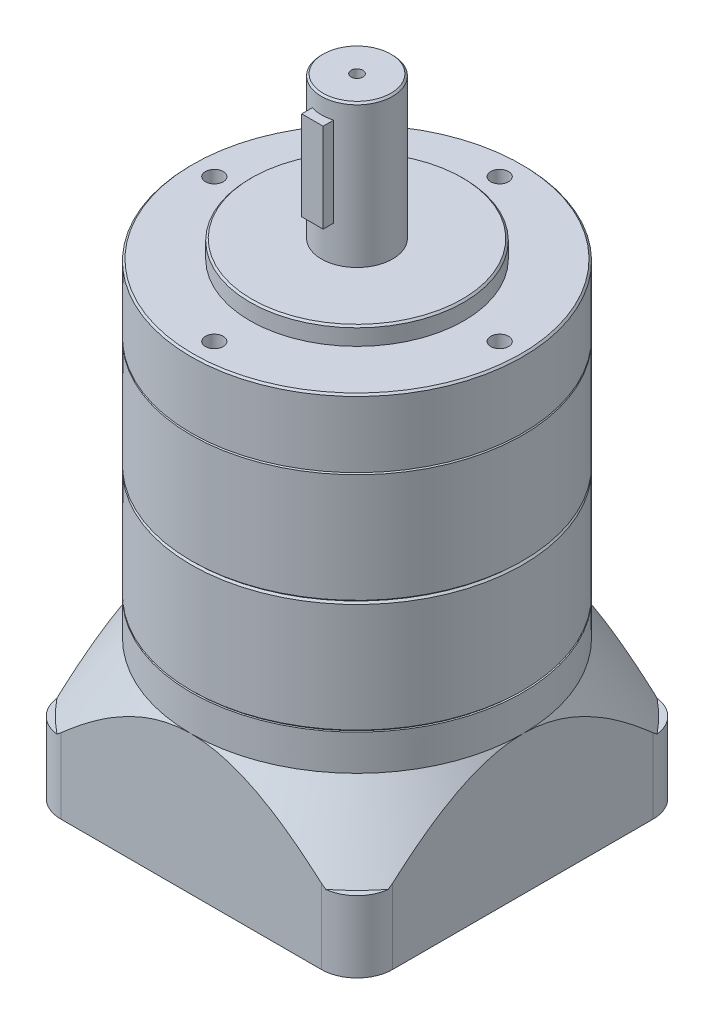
ISO-10303-21;
HEADER;
FILE_DESCRIPTION(('STEP AP214'),'2;1');
FILE_NAME('part.step','',(''),(''),'','','');
FILE_SCHEMA(('AUTOMOTIVE_DESIGN { 1 0 10303 214 1 1 1 1 }'));
ENDSEC;
DATA;
#1=APPLICATION_CONTEXT('core data for automotive mechanical design processes');
#2=APPLICATION_PROTOCOL_DEFINITION('international standard','automotive_design',2000,#1);
#3=PRODUCT_CONTEXT('',#1,'mechanical');
#4=PRODUCT('Part','Part','',(#3));
#5=PRODUCT_RELATED_PRODUCT_CATEGORY('part','',(#4));
#6=PRODUCT_DEFINITION_FORMATION('','',#4);
#7=PRODUCT_DEFINITION_CONTEXT('part definition',#1,'design');
#8=PRODUCT_DEFINITION('design','',#6,#7);
#9=PRODUCT_DEFINITION_SHAPE('','',#8);
#10=(LENGTH_UNIT() NAMED_UNIT(*) SI_UNIT(.MILLI.,.METRE.));
#11=(NAMED_UNIT(*) PLANE_ANGLE_UNIT() SI_UNIT($,.RADIAN.));
#12=(NAMED_UNIT(*) SI_UNIT($,.STERADIAN.) SOLID_ANGLE_UNIT());
#13=UNCERTAINTY_MEASURE_WITH_UNIT(LENGTH_MEASURE(1.E-05),#10,'distance_accuracy_value','');
#14=(GEOMETRIC_REPRESENTATION_CONTEXT(3) GLOBAL_UNCERTAINTY_ASSIGNED_CONTEXT((#13)) GLOBAL_UNIT_ASSIGNED_CONTEXT((#10,
#11,#12)) REPRESENTATION_CONTEXT('',''));
#15=CARTESIAN_POINT('',(0.,0.,0.));
#16=DIRECTION('',(0.,0.,1.));
#17=DIRECTION('',(1.,0.,0.));
#18=AXIS2_PLACEMENT_3D('',#15,#16,#17);
#19=CARTESIAN_POINT('',(0.,176.,0.));
#20=DIRECTION('',(0.,-1.,0.));
#21=DIRECTION('',(0.,0.,-1.));
#22=AXIS2_PLACEMENT_3D('',#19,#20,#21);
#23=CYLINDRICAL_SURFACE('',#22,10.);
#24=CARTESIAN_POINT('',(0.,136.,0.));
#25=DIRECTION('',(0.,1.,0.));
#26=DIRECTION('',(0.,0.,1.));
#27=AXIS2_PLACEMENT_3D('',#24,#25,#26);
#28=CIRCLE('',#27,10.);
#29=CARTESIAN_POINT('',(0.,136.,10.));
#30=VERTEX_POINT('',#29);
#31=EDGE_CURVE('E157',#30,#30,#28,.T.);
#32=ORIENTED_EDGE('',*,*,#31,.T.);
#33=EDGE_LOOP('',(#32));
#34=FACE_BOUND('',#33,.T.);
#35=CARTESIAN_POINT('',(0.,175.5,0.));
#36=DIRECTION('',(0.,1.,0.));
#37=DIRECTION('',(0.,0.,1.));
#38=AXIS2_PLACEMENT_3D('',#35,#36,#37);
#39=CIRCLE('',#38,10.);
#40=CARTESIAN_POINT('',(0.,175.5,10.));
#41=VERTEX_POINT('',#40);
#42=EDGE_CURVE('E169',#41,#41,#39,.F.);
#43=ORIENTED_EDGE('',*,*,#42,.T.);
#44=EDGE_LOOP('',(#43));
#45=FACE_BOUND('',#44,.T.);
#46=DIRECTION('',(0.,-1.,0.));
#47=VECTOR('',#46,1.);
#48=CARTESIAN_POINT('',(-3.00000000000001,176.,9.53939201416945));
#49=LINE('',#48,#47);
#50=CARTESIAN_POINT('',(-3.,171.,9.53939201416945));
#51=VERTEX_POINT('',#50);
#52=CARTESIAN_POINT('',(-3.,146.,9.53939201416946));
#53=VERTEX_POINT('',#52);
#54=EDGE_CURVE('E13',#51,#53,#49,.T.);
#55=ORIENTED_EDGE('',*,*,#54,.F.);
#56=CARTESIAN_POINT('',(0.,171.,0.));
#57=DIRECTION('',(0.,-1.,0.));
#58=DIRECTION('',(0.,0.,-1.));
#59=AXIS2_PLACEMENT_3D('',#56,#57,#58);
#60=CIRCLE('',#59,10.);
#61=CARTESIAN_POINT('',(3.,171.,9.53939201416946));
#62=VERTEX_POINT('',#61);
#63=EDGE_CURVE('E184',#62,#51,#60,.T.);
#64=ORIENTED_EDGE('',*,*,#63,.F.);
#65=DIRECTION('',(0.,-1.,0.));
#66=VECTOR('',#65,1.);
#67=CARTESIAN_POINT('',(3.,176.,9.53939201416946));
#68=LINE('',#67,#66);
#69=CARTESIAN_POINT('',(3.,146.,9.53939201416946));
#70=VERTEX_POINT('',#69);
#71=EDGE_CURVE('E65',#70,#62,#68,.F.);
#72=ORIENTED_EDGE('',*,*,#71,.F.);
#73=CARTESIAN_POINT('',(0.,146.,0.));
#74=DIRECTION('',(0.,1.,0.));
#75=DIRECTION('',(0.,0.,1.));
#76=AXIS2_PLACEMENT_3D('',#73,#74,#75);
#77=CIRCLE('',#76,10.);
#78=EDGE_CURVE('E55',#53,#70,#77,.T.);
#79=ORIENTED_EDGE('',*,*,#78,.F.);
#80=EDGE_LOOP('',(#55,#64,#72,#79));
#81=FACE_BOUND('',#80,.T.);
#82=ADVANCED_FACE('F47',(#34,#45,#81),#23,.T.);
#83=CARTESIAN_POINT('',(0.,136.,0.));
#84=DIRECTION('',(0.,1.,0.));
#85=DIRECTION('',(0.,0.,1.));
#86=AXIS2_PLACEMENT_3D('',#83,#84,#85);
#87=PLANE('',#86);
#88=CARTESIAN_POINT('',(0.,136.,0.));
#89=DIRECTION('',(0.,1.,0.));
#90=DIRECTION('',(0.,0.,1.));
#91=AXIS2_PLACEMENT_3D('',#88,#89,#90);
#92=CIRCLE('',#91,29.5);
#93=CARTESIAN_POINT('',(0.,136.,29.5));
#94=VERTEX_POINT('',#93);
#95=EDGE_CURVE('E178',#94,#94,#92,.T.);
#96=ORIENTED_EDGE('',*,*,#95,.T.);
#97=EDGE_LOOP('',(#96));
#98=FACE_BOUND('',#97,.T.);
#99=ORIENTED_EDGE('',*,*,#31,.F.);
#100=EDGE_LOOP('',(#99));
#101=FACE_BOUND('',#100,.T.);
#102=ADVANCED_FACE('F212',(#98,#101),#87,.T.);
#103=CARTESIAN_POINT('',(0.,131.,0.));
#104=DIRECTION('',(0.,1.,0.));
#105=DIRECTION('',(0.,0.,1.));
#106=AXIS2_PLACEMENT_3D('',#103,#104,#105);
#107=PLANE('',#106);
#108=CARTESIAN_POINT('',(-40.,131.,-4.18977760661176E-13));
#109=DIRECTION('',(0.,1.,0.));
#110=DIRECTION('',(0.,0.,1.));
#111=AXIS2_PLACEMENT_3D('',#108,#109,#110);
#112=CIRCLE('',#111,2.5);
#113=CARTESIAN_POINT('',(-40.,131.,2.49999999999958));
#114=VERTEX_POINT('',#113);
#115=EDGE_CURVE('E133',#114,#114,#112,.T.);
#116=ORIENTED_EDGE('',*,*,#115,.F.);
#117=EDGE_LOOP('',(#116));
#118=FACE_BOUND('',#117,.T.);
#119=CARTESIAN_POINT('',(0.,131.,40.));
#120=DIRECTION('',(0.,1.,0.));
#121=DIRECTION('',(0.,0.,1.));
#122=AXIS2_PLACEMENT_3D('',#119,#120,#121);
#123=CIRCLE('',#122,2.5);
#124=CARTESIAN_POINT('',(0.,131.,42.5));
#125=VERTEX_POINT('',#124);
#126=EDGE_CURVE('E139',#125,#125,#123,.T.);
#127=ORIENTED_EDGE('',*,*,#126,.F.);
#128=EDGE_LOOP('',(#127));
#129=FACE_BOUND('',#128,.T.);
#130=CARTESIAN_POINT('',(40.,131.,1.39659253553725E-13));
#131=DIRECTION('',(0.,1.,0.));
#132=DIRECTION('',(0.,0.,1.));
#133=AXIS2_PLACEMENT_3D('',#130,#131,#132);
#134=CIRCLE('',#133,2.5);
#135=CARTESIAN_POINT('',(40.,131.,2.50000000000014));
#136=VERTEX_POINT('',#135);
#137=EDGE_CURVE('E145',#136,#136,#134,.T.);
#138=ORIENTED_EDGE('',*,*,#137,.F.);
#139=EDGE_LOOP('',(#138));
#140=FACE_BOUND('',#139,.T.);
#141=CARTESIAN_POINT('',(0.,131.,-40.));
#142=DIRECTION('',(0.,1.,0.));
#143=DIRECTION('',(0.,0.,1.));
#144=AXIS2_PLACEMENT_3D('',#141,#142,#143);
#145=CIRCLE('',#144,2.5);
#146=CARTESIAN_POINT('',(0.,131.,-37.5));
#147=VERTEX_POINT('',#146);
#148=EDGE_CURVE('E151',#147,#147,#145,.T.);
#149=ORIENTED_EDGE('',*,*,#148,.F.);
#150=EDGE_LOOP('',(#149));
#151=FACE_BOUND('',#150,.T.);
#152=CARTESIAN_POINT('',(0.,131.,0.));
#153=DIRECTION('',(0.,1.,0.));
#154=DIRECTION('',(0.,0.,1.));
#155=AXIS2_PLACEMENT_3D('',#152,#153,#154);
#156=CIRCLE('',#155,46.);
#157=CARTESIAN_POINT('',(0.,131.,46.));
#158=VERTEX_POINT('',#157);
#159=EDGE_CURVE('E172',#158,#158,#156,.T.);
#160=ORIENTED_EDGE('',*,*,#159,.T.);
#161=EDGE_LOOP('',(#160));
#162=FACE_BOUND('',#161,.T.);
#163=CARTESIAN_POINT('',(0.,131.,0.));
#164=DIRECTION('',(0.,1.,0.));
#165=DIRECTION('',(0.,0.,1.));
#166=AXIS2_PLACEMENT_3D('',#163,#164,#165);
#167=CIRCLE('',#166,30.);
#168=CARTESIAN_POINT('',(0.,131.,30.));
#169=VERTEX_POINT('',#168);
#170=EDGE_CURVE('E160',#169,#169,#167,.T.);
#171=ORIENTED_EDGE('',*,*,#170,.F.);
#172=EDGE_LOOP('',(#171));
#173=FACE_BOUND('',#172,.T.);
#174=ADVANCED_FACE('F218',(#118,#129,#140,#151,#162,#173),#107,.T.);
#175=CARTESIAN_POINT('',(0.,131.,0.));
#176=DIRECTION('',(0.,-1.,0.));
#177=DIRECTION('',(0.,0.,-1.));
#178=AXIS2_PLACEMENT_3D('',#175,#176,#177);
#179=CYLINDRICAL_SURFACE('',#178,46.5);
#180=CARTESIAN_POINT('',(0.,130.5,0.));
#181=DIRECTION('',(0.,1.,0.));
#182=DIRECTION('',(0.,0.,1.));
#183=AXIS2_PLACEMENT_3D('',#180,#181,#182);
#184=CIRCLE('',#183,46.5);
#185=CARTESIAN_POINT('',(0.,130.5,46.5));
#186=VERTEX_POINT('',#185);
#187=EDGE_CURVE('E175',#186,#186,#184,.F.);
#188=ORIENTED_EDGE('',*,*,#187,.T.);
#189=EDGE_LOOP('',(#188));
#190=FACE_BOUND('',#189,.T.);
#191=CARTESIAN_POINT('',(0.,112.,0.));
#192=DIRECTION('',(0.,1.,0.));
#193=DIRECTION('',(0.,0.,1.));
#194=AXIS2_PLACEMENT_3D('',#191,#192,#193);
#195=CIRCLE('',#194,46.5);
#196=CARTESIAN_POINT('',(0.,112.,46.5));
#197=VERTEX_POINT('',#196);
#198=EDGE_CURVE('E163',#197,#197,#195,.T.);
#199=ORIENTED_EDGE('',*,*,#198,.T.);
#200=EDGE_LOOP('',(#199));
#201=FACE_BOUND('',#200,.T.);
#202=ADVANCED_FACE('F233',(#190,#201),#179,.T.);
#203=CARTESIAN_POINT('',(0.,112.,0.));
#204=DIRECTION('',(0.,1.,0.));
#205=DIRECTION('',(0.,0.,1.));
#206=AXIS2_PLACEMENT_3D('',#203,#204,#205);
#207=PLANE('',#206);
#208=ORIENTED_EDGE('',*,*,#198,.F.);
#209=EDGE_LOOP('',(#208));
#210=FACE_BOUND('',#209,.T.);
#211=ADVANCED_FACE('F229',(#210),#207,.F.);
#212=CARTESIAN_POINT('',(0.,136.,0.));
#213=DIRECTION('',(0.,-1.,0.));
#214=DIRECTION('',(0.,0.,-1.));
#215=AXIS2_PLACEMENT_3D('',#212,#213,#214);
#216=CYLINDRICAL_SURFACE('',#215,30.);
#217=CARTESIAN_POINT('',(0.,135.5,0.));
#218=DIRECTION('',(0.,1.,0.));
#219=DIRECTION('',(0.,0.,1.));
#220=AXIS2_PLACEMENT_3D('',#217,#218,#219);
#221=CIRCLE('',#220,30.);
#222=CARTESIAN_POINT('',(0.,135.5,30.));
#223=VERTEX_POINT('',#222);
#224=EDGE_CURVE('E181',#223,#223,#221,.F.);
#225=ORIENTED_EDGE('',*,*,#224,.T.);
#226=EDGE_LOOP('',(#225));
#227=FACE_BOUND('',#226,.T.);
#228=ORIENTED_EDGE('',*,*,#170,.T.);
#229=EDGE_LOOP('',(#228));
#230=FACE_BOUND('',#229,.T.);
#231=ADVANCED_FACE('F226',(#227,#230),#216,.T.);
#232=CARTESIAN_POINT('',(0.,176.,0.));
#233=DIRECTION('',(0.,1.,0.));
#234=DIRECTION('',(0.,0.,1.));
#235=AXIS2_PLACEMENT_3D('',#232,#233,#234);
#236=PLANE('',#235);
#237=CARTESIAN_POINT('',(0.,176.,0.));
#238=DIRECTION('',(0.,1.,0.));
#239=DIRECTION('',(0.,0.,1.));
#240=AXIS2_PLACEMENT_3D('',#237,#238,#239);
#241=CIRCLE('',#240,1.65);
#242=CARTESIAN_POINT('',(0.,176.,1.65));
#243=VERTEX_POINT('',#242);
#244=EDGE_CURVE('E108',#243,#243,#241,.T.);
#245=ORIENTED_EDGE('',*,*,#244,.F.);
#246=EDGE_LOOP('',(#245));
#247=FACE_BOUND('',#246,.T.);
#248=CARTESIAN_POINT('',(0.,176.,0.));
#249=DIRECTION('',(0.,1.,0.));
#250=DIRECTION('',(0.,0.,1.));
#251=AXIS2_PLACEMENT_3D('',#248,#249,#250);
#252=CIRCLE('',#251,9.49999999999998);
#253=CARTESIAN_POINT('',(0.,176.,9.49999999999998));
#254=VERTEX_POINT('',#253);
#255=EDGE_CURVE('E166',#254,#254,#252,.T.);
#256=ORIENTED_EDGE('',*,*,#255,.T.);
#257=EDGE_LOOP('',(#256));
#258=FACE_BOUND('',#257,.T.);
#259=ADVANCED_FACE('F223',(#247,#258),#236,.T.);
#260=CARTESIAN_POINT('',(0.,176.,0.));
#261=DIRECTION('',(0.,-1.,0.));
#262=DIRECTION('',(0.,0.,-1.));
#263=AXIS2_PLACEMENT_3D('',#260,#261,#262);
#264=CONICAL_SURFACE('',#263,9.49999999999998,0.78539816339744);
#265=ORIENTED_EDGE('',*,*,#42,.F.);
#266=EDGE_LOOP('',(#265));
#267=FACE_BOUND('',#266,.T.);
#268=ORIENTED_EDGE('',*,*,#255,.F.);
#269=EDGE_LOOP('',(#268));
#270=FACE_BOUND('',#269,.T.);
#271=ADVANCED_FACE('F241',(#267,#270),#264,.T.);
#272=CARTESIAN_POINT('',(0.,131.,0.));
#273=DIRECTION('',(0.,-1.,0.));
#274=DIRECTION('',(0.,0.,-1.));
#275=AXIS2_PLACEMENT_3D('',#272,#273,#274);
#276=CONICAL_SURFACE('',#275,46.,0.785398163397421);
#277=ORIENTED_EDGE('',*,*,#187,.F.);
#278=EDGE_LOOP('',(#277));
#279=FACE_BOUND('',#278,.T.);
#280=ORIENTED_EDGE('',*,*,#159,.F.);
#281=EDGE_LOOP('',(#280));
#282=FACE_BOUND('',#281,.T.);
#283=ADVANCED_FACE('F243',(#279,#282),#276,.T.);
#284=CARTESIAN_POINT('',(0.,136.,0.));
#285=DIRECTION('',(0.,-1.,0.));
#286=DIRECTION('',(0.,0.,-1.));
#287=AXIS2_PLACEMENT_3D('',#284,#285,#286);
#288=CONICAL_SURFACE('',#287,29.5,0.785398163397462);
#289=ORIENTED_EDGE('',*,*,#224,.F.);
#290=EDGE_LOOP('',(#289));
#291=FACE_BOUND('',#290,.T.);
#292=ORIENTED_EDGE('',*,*,#95,.F.);
#293=EDGE_LOOP('',(#292));
#294=FACE_BOUND('',#293,.T.);
#295=ADVANCED_FACE('F49',(#291,#294),#288,.T.);
#296=CARTESIAN_POINT('',(0.,116.,-40.));
#297=DIRECTION('',(0.,1.,0.));
#298=DIRECTION('',(0.,0.,1.));
#299=AXIS2_PLACEMENT_3D('',#296,#297,#298);
#300=CONICAL_SURFACE('',#299,2.5,1.02974425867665);
#301=CARTESIAN_POINT('',(0.,114.497848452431,-40.));
#302=VERTEX_POINT('',#301);
#303=VERTEX_LOOP('',#302);
#304=FACE_BOUND('',#303,.T.);
#305=CARTESIAN_POINT('',(0.,116.,-40.));
#306=DIRECTION('',(0.,1.,0.));
#307=DIRECTION('',(0.,0.,1.));
#308=AXIS2_PLACEMENT_3D('',#305,#306,#307);
#309=CIRCLE('',#308,2.5);
#310=CARTESIAN_POINT('',(0.,116.,-37.5));
#311=VERTEX_POINT('',#310);
#312=EDGE_CURVE('E154',#311,#311,#309,.T.);
#313=ORIENTED_EDGE('',*,*,#312,.T.);
#314=EDGE_LOOP('',(#313));
#315=FACE_BOUND('',#314,.T.);
#316=ADVANCED_FACE('F250',(#304,#315),#300,.F.);
#317=CARTESIAN_POINT('',(0.,131.,-40.));
#318=DIRECTION('',(0.,1.,0.));
#319=DIRECTION('',(0.,0.,1.));
#320=AXIS2_PLACEMENT_3D('',#317,#318,#319);
#321=CYLINDRICAL_SURFACE('',#320,2.5);
#322=ORIENTED_EDGE('',*,*,#312,.F.);
#323=EDGE_LOOP('',(#322));
#324=FACE_BOUND('',#323,.T.);
#325=ORIENTED_EDGE('',*,*,#148,.T.);
#326=EDGE_LOOP('',(#325));
#327=FACE_BOUND('',#326,.T.);
#328=ADVANCED_FACE('F264',(#324,#327),#321,.F.);
#329=CARTESIAN_POINT('',(40.,116.,1.39659253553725E-13));
#330=DIRECTION('',(0.,1.,0.));
#331=DIRECTION('',(0.,0.,1.));
#332=AXIS2_PLACEMENT_3D('',#329,#330,#331);
#333=CONICAL_SURFACE('',#332,2.5,1.02974425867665);
#334=CARTESIAN_POINT('',(40.,114.497848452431,1.39659253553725E-13));
#335=VERTEX_POINT('',#334);
#336=VERTEX_LOOP('',#335);
#337=FACE_BOUND('',#336,.T.);
#338=CARTESIAN_POINT('',(40.,116.,1.39659253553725E-13));
#339=DIRECTION('',(0.,1.,0.));
#340=DIRECTION('',(0.,0.,1.));
#341=AXIS2_PLACEMENT_3D('',#338,#339,#340);
#342=CIRCLE('',#341,2.5);
#343=CARTESIAN_POINT('',(40.,116.,2.50000000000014));
#344=VERTEX_POINT('',#343);
#345=EDGE_CURVE('E148',#344,#344,#342,.T.);
#346=ORIENTED_EDGE('',*,*,#345,.T.);
#347=EDGE_LOOP('',(#346));
#348=FACE_BOUND('',#347,.T.);
#349=ADVANCED_FACE('F274',(#337,#348),#333,.F.);
#350=CARTESIAN_POINT('',(40.,131.,1.39659253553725E-13));
#351=DIRECTION('',(0.,1.,0.));
#352=DIRECTION('',(0.,0.,1.));
#353=AXIS2_PLACEMENT_3D('',#350,#351,#352);
#354=CYLINDRICAL_SURFACE('',#353,2.5);
#355=ORIENTED_EDGE('',*,*,#345,.F.);
#356=EDGE_LOOP('',(#355));
#357=FACE_BOUND('',#356,.T.);
#358=ORIENTED_EDGE('',*,*,#137,.T.);
#359=EDGE_LOOP('',(#358));
#360=FACE_BOUND('',#359,.T.);
#361=ADVANCED_FACE('F281',(#357,#360),#354,.F.);
#362=CARTESIAN_POINT('',(0.,116.,40.));
#363=DIRECTION('',(0.,1.,0.));
#364=DIRECTION('',(0.,0.,1.));
#365=AXIS2_PLACEMENT_3D('',#362,#363,#364);
#366=CONICAL_SURFACE('',#365,2.5,1.02974425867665);
#367=CARTESIAN_POINT('',(0.,114.497848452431,40.));
#368=VERTEX_POINT('',#367);
#369=VERTEX_LOOP('',#368);
#370=FACE_BOUND('',#369,.T.);
#371=CARTESIAN_POINT('',(0.,116.,40.));
#372=DIRECTION('',(0.,1.,0.));
#373=DIRECTION('',(0.,0.,1.));
#374=AXIS2_PLACEMENT_3D('',#371,#372,#373);
#375=CIRCLE('',#374,2.5);
#376=CARTESIAN_POINT('',(0.,116.,42.5));
#377=VERTEX_POINT('',#376);
#378=EDGE_CURVE('E142',#377,#377,#375,.T.);
#379=ORIENTED_EDGE('',*,*,#378,.T.);
#380=EDGE_LOOP('',(#379));
#381=FACE_BOUND('',#380,.T.);
#382=ADVANCED_FACE('F285',(#370,#381),#366,.F.);
#383=CARTESIAN_POINT('',(0.,131.,40.));
#384=DIRECTION('',(0.,1.,0.));
#385=DIRECTION('',(0.,0.,1.));
#386=AXIS2_PLACEMENT_3D('',#383,#384,#385);
#387=CYLINDRICAL_SURFACE('',#386,2.5);
#388=ORIENTED_EDGE('',*,*,#378,.F.);
#389=EDGE_LOOP('',(#388));
#390=FACE_BOUND('',#389,.T.);
#391=ORIENTED_EDGE('',*,*,#126,.T.);
#392=EDGE_LOOP('',(#391));
#393=FACE_BOUND('',#392,.T.);
#394=ADVANCED_FACE('F289',(#390,#393),#387,.F.);
#395=CARTESIAN_POINT('',(-40.,116.,-4.18977760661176E-13));
#396=DIRECTION('',(0.,1.,0.));
#397=DIRECTION('',(0.,0.,1.));
#398=AXIS2_PLACEMENT_3D('',#395,#396,#397);
#399=CONICAL_SURFACE('',#398,2.5,1.02974425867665);
#400=CARTESIAN_POINT('',(-40.,114.497848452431,-4.18977760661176E-13));
#401=VERTEX_POINT('',#400);
#402=VERTEX_LOOP('',#401);
#403=FACE_BOUND('',#402,.T.);
#404=CARTESIAN_POINT('',(-40.,116.,-4.18977760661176E-13));
#405=DIRECTION('',(0.,1.,0.));
#406=DIRECTION('',(0.,0.,1.));
#407=AXIS2_PLACEMENT_3D('',#404,#405,#406);
#408=CIRCLE('',#407,2.5);
#409=CARTESIAN_POINT('',(-40.,116.,2.49999999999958));
#410=VERTEX_POINT('',#409);
#411=EDGE_CURVE('E136',#410,#410,#408,.T.);
#412=ORIENTED_EDGE('',*,*,#411,.T.);
#413=EDGE_LOOP('',(#412));
#414=FACE_BOUND('',#413,.T.);
#415=ADVANCED_FACE('F293',(#403,#414),#399,.F.);
#416=CARTESIAN_POINT('',(-40.,131.,-4.18977760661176E-13));
#417=DIRECTION('',(0.,1.,0.));
#418=DIRECTION('',(0.,0.,1.));
#419=AXIS2_PLACEMENT_3D('',#416,#417,#418);
#420=CYLINDRICAL_SURFACE('',#419,2.5);
#421=ORIENTED_EDGE('',*,*,#411,.F.);
#422=EDGE_LOOP('',(#421));
#423=FACE_BOUND('',#422,.T.);
#424=ORIENTED_EDGE('',*,*,#115,.T.);
#425=EDGE_LOOP('',(#424));
#426=FACE_BOUND('',#425,.T.);
#427=ADVANCED_FACE('F297',(#423,#426),#420,.F.);
#428=CARTESIAN_POINT('',(-3.,171.,12.5));
#429=DIRECTION('',(1.,0.,0.));
#430=DIRECTION('',(0.,1.,0.));
#431=AXIS2_PLACEMENT_3D('',#428,#429,#430);
#432=PLANE('',#431);
#433=DIRECTION('',(0.,0.,-1.));
#434=VECTOR('',#433,1.);
#435=CARTESIAN_POINT('',(-3.,171.,12.5));
#436=LINE('',#435,#434);
#437=CARTESIAN_POINT('',(-3.,171.,12.5));
#438=VERTEX_POINT('',#437);
#439=EDGE_CURVE('E121',#438,#51,#436,.T.);
#440=ORIENTED_EDGE('',*,*,#439,.T.);
#441=ORIENTED_EDGE('',*,*,#54,.T.);
#442=DIRECTION('',(0.,0.,-1.));
#443=VECTOR('',#442,1.);
#444=CARTESIAN_POINT('',(-3.,146.,12.5));
#445=LINE('',#444,#443);
#446=CARTESIAN_POINT('',(-3.,146.,12.5));
#447=VERTEX_POINT('',#446);
#448=EDGE_CURVE('E130',#447,#53,#445,.T.);
#449=ORIENTED_EDGE('',*,*,#448,.F.);
#450=DIRECTION('',(0.,-1.,0.));
#451=VECTOR('',#450,1.);
#452=CARTESIAN_POINT('',(-3.,171.,12.5));
#453=LINE('',#452,#451);
#454=EDGE_CURVE('E107',#438,#447,#453,.T.);
#455=ORIENTED_EDGE('',*,*,#454,.F.);
#456=EDGE_LOOP('',(#440,#441,#449,#455));
#457=FACE_BOUND('',#456,.T.);
#458=ADVANCED_FACE('F200',(#457),#432,.F.);
#459=CARTESIAN_POINT('',(-3.,146.,12.5));
#460=DIRECTION('',(0.,1.,0.));
#461=DIRECTION('',(0.,0.,1.));
#462=AXIS2_PLACEMENT_3D('',#459,#460,#461);
#463=PLANE('',#462);
#464=ORIENTED_EDGE('',*,*,#448,.T.);
#465=ORIENTED_EDGE('',*,*,#78,.T.);
#466=DIRECTION('',(0.,0.,-1.));
#467=VECTOR('',#466,1.);
#468=CARTESIAN_POINT('',(3.,146.,12.5));
#469=LINE('',#468,#467);
#470=CARTESIAN_POINT('',(3.,146.,12.5));
#471=VERTEX_POINT('',#470);
#472=EDGE_CURVE('E127',#471,#70,#469,.T.);
#473=ORIENTED_EDGE('',*,*,#472,.F.);
#474=DIRECTION('',(1.,0.,0.));
#475=VECTOR('',#474,1.);
#476=CARTESIAN_POINT('',(-3.,146.,12.5));
#477=LINE('',#476,#475);
#478=EDGE_CURVE('E111',#447,#471,#477,.T.);
#479=ORIENTED_EDGE('',*,*,#478,.F.);
#480=EDGE_LOOP('',(#464,#465,#473,#479));
#481=FACE_BOUND('',#480,.T.);
#482=ADVANCED_FACE('F189',(#481),#463,.F.);
#483=CARTESIAN_POINT('',(3.,171.,12.5));
#484=DIRECTION('',(-1.,0.,0.));
#485=DIRECTION('',(0.,-1.,0.));
#486=AXIS2_PLACEMENT_3D('',#483,#484,#485);
#487=PLANE('',#486);
#488=ORIENTED_EDGE('',*,*,#472,.T.);
#489=ORIENTED_EDGE('',*,*,#71,.T.);
#490=DIRECTION('',(0.,0.,-1.));
#491=VECTOR('',#490,1.);
#492=CARTESIAN_POINT('',(3.,171.,12.5));
#493=LINE('',#492,#491);
#494=CARTESIAN_POINT('',(3.,171.,12.5));
#495=VERTEX_POINT('',#494);
#496=EDGE_CURVE('E124',#495,#62,#493,.T.);
#497=ORIENTED_EDGE('',*,*,#496,.F.);
#498=DIRECTION('',(0.,1.,0.));
#499=VECTOR('',#498,1.);
#500=CARTESIAN_POINT('',(3.,171.,12.5));
#501=LINE('',#500,#499);
#502=EDGE_CURVE('E117',#471,#495,#501,.T.);
#503=ORIENTED_EDGE('',*,*,#502,.F.);
#504=EDGE_LOOP('',(#488,#489,#497,#503));
#505=FACE_BOUND('',#504,.T.);
#506=ADVANCED_FACE('F193',(#505),#487,.F.);
#507=CARTESIAN_POINT('',(-3.,171.,12.5));
#508=DIRECTION('',(0.,-1.,0.));
#509=DIRECTION('',(0.,0.,-1.));
#510=AXIS2_PLACEMENT_3D('',#507,#508,#509);
#511=PLANE('',#510);
#512=ORIENTED_EDGE('',*,*,#496,.T.);
#513=ORIENTED_EDGE('',*,*,#63,.T.);
#514=ORIENTED_EDGE('',*,*,#439,.F.);
#515=DIRECTION('',(-1.,0.,0.));
#516=VECTOR('',#515,1.);
#517=CARTESIAN_POINT('',(-3.,171.,12.5));
#518=LINE('',#517,#516);
#519=EDGE_CURVE('E119',#495,#438,#518,.T.);
#520=ORIENTED_EDGE('',*,*,#519,.F.);
#521=EDGE_LOOP('',(#512,#513,#514,#520));
#522=FACE_BOUND('',#521,.T.);
#523=ADVANCED_FACE('F202',(#522),#511,.F.);
#524=CARTESIAN_POINT('',(0.,0.,12.5));
#525=DIRECTION('',(0.,0.,1.));
#526=DIRECTION('',(1.,0.,0.));
#527=AXIS2_PLACEMENT_3D('',#524,#525,#526);
#528=PLANE('',#527);
#529=ORIENTED_EDGE('',*,*,#454,.T.);
#530=ORIENTED_EDGE('',*,*,#478,.T.);
#531=ORIENTED_EDGE('',*,*,#502,.T.);
#532=ORIENTED_EDGE('',*,*,#519,.T.);
#533=EDGE_LOOP('',(#529,#530,#531,#532));
#534=FACE_BOUND('',#533,.T.);
#535=ADVANCED_FACE('F101',(#534),#528,.T.);
#536=CARTESIAN_POINT('',(0.,165.9,0.));
#537=DIRECTION('',(0.,1.,0.));
#538=DIRECTION('',(0.,0.,1.));
#539=AXIS2_PLACEMENT_3D('',#536,#537,#538);
#540=CONICAL_SURFACE('',#539,1.65,1.02974425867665);
#541=CARTESIAN_POINT('',(0.,164.908579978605,0.));
#542=VERTEX_POINT('',#541);
#543=VERTEX_LOOP('',#542);
#544=FACE_BOUND('',#543,.T.);
#545=CARTESIAN_POINT('',(0.,165.9,0.));
#546=DIRECTION('',(0.,1.,0.));
#547=DIRECTION('',(0.,0.,1.));
#548=AXIS2_PLACEMENT_3D('',#545,#546,#547);
#549=CIRCLE('',#548,1.65);
#550=CARTESIAN_POINT('',(0.,165.9,1.65));
#551=VERTEX_POINT('',#550);
#552=EDGE_CURVE('E105',#551,#551,#549,.T.);
#553=ORIENTED_EDGE('',*,*,#552,.T.);
#554=EDGE_LOOP('',(#553));
#555=FACE_BOUND('',#554,.T.);
#556=ADVANCED_FACE('F97',(#544,#555),#540,.F.);
#557=CARTESIAN_POINT('',(0.,176.,0.));
#558=DIRECTION('',(0.,1.,0.));
#559=DIRECTION('',(0.,0.,1.));
#560=AXIS2_PLACEMENT_3D('',#557,#558,#559);
#561=CYLINDRICAL_SURFACE('',#560,1.65);
#562=ORIENTED_EDGE('',*,*,#552,.F.);
#563=EDGE_LOOP('',(#562));
#564=FACE_BOUND('',#563,.T.);
#565=ORIENTED_EDGE('',*,*,#244,.T.);
#566=EDGE_LOOP('',(#565));
#567=FACE_BOUND('',#566,.T.);
#568=ADVANCED_FACE('F100',(#564,#567),#561,.F.);
#569=CLOSED_SHELL('',(#82,#102,#174,#202,#211,#231,#259,#271,#283,#295,#316,#328,#349,#361,#382,
#394,#415,#427,#458,#482,#506,#523,#535,#556,#568));
#570=MANIFOLD_SOLID_BREP('B2',#569);
#571=CARTESIAN_POINT('',(0.,112.,0.));
#572=DIRECTION('',(0.,-1.,0.));
#573=DIRECTION('',(0.,0.,-1.));
#574=AXIS2_PLACEMENT_3D('',#571,#572,#573);
#575=CYLINDRICAL_SURFACE('',#574,46.5);
#576=CARTESIAN_POINT('',(0.,81.,0.));
#577=DIRECTION('',(0.,1.,0.));
#578=DIRECTION('',(0.,0.,1.));
#579=AXIS2_PLACEMENT_3D('',#576,#577,#578);
#580=CIRCLE('',#579,46.5);
#581=CARTESIAN_POINT('',(0.,81.,46.5));
#582=VERTEX_POINT('',#581);
#583=EDGE_CURVE('E515',#582,#582,#580,.T.);
#584=ORIENTED_EDGE('',*,*,#583,.T.);
#585=EDGE_LOOP('',(#584));
#586=FACE_BOUND('',#585,.T.);
#587=CARTESIAN_POINT('',(0.,111.5,0.));
#588=DIRECTION('',(0.,1.,0.));
#589=DIRECTION('',(0.,0.,1.));
#590=AXIS2_PLACEMENT_3D('',#587,#588,#589);
#591=CIRCLE('',#590,46.5);
#592=CARTESIAN_POINT('',(0.,111.5,46.5));
#593=VERTEX_POINT('',#592);
#594=EDGE_CURVE('E519',#593,#593,#591,.F.);
#595=ORIENTED_EDGE('',*,*,#594,.T.);
#596=EDGE_LOOP('',(#595));
#597=FACE_BOUND('',#596,.T.);
#598=ADVANCED_FACE('F504',(#586,#597),#575,.T.);
#599=CARTESIAN_POINT('',(0.,112.,0.));
#600=DIRECTION('',(0.,1.,0.));
#601=DIRECTION('',(0.,0.,1.));
#602=AXIS2_PLACEMENT_3D('',#599,#600,#601);
#603=PLANE('',#602);
#604=CARTESIAN_POINT('',(0.,112.,0.));
#605=DIRECTION('',(0.,1.,0.));
#606=DIRECTION('',(0.,0.,1.));
#607=AXIS2_PLACEMENT_3D('',#604,#605,#606);
#608=CIRCLE('',#607,46.);
#609=CARTESIAN_POINT('',(0.,112.,46.));
#610=VERTEX_POINT('',#609);
#611=EDGE_CURVE('E46',#610,#610,#608,.T.);
#612=ORIENTED_EDGE('',*,*,#611,.T.);
#613=EDGE_LOOP('',(#612));
#614=FACE_BOUND('',#613,.T.);
#615=ADVANCED_FACE('F535',(#614),#603,.T.);
#616=CARTESIAN_POINT('',(0.,80.5,0.));
#617=DIRECTION('',(0.,1.,0.));
#618=DIRECTION('',(0.,0.,1.));
#619=AXIS2_PLACEMENT_3D('',#616,#617,#618);
#620=PLANE('',#619);
#621=CARTESIAN_POINT('',(0.,80.5,0.));
#622=DIRECTION('',(0.,1.,0.));
#623=DIRECTION('',(0.,0.,1.));
#624=AXIS2_PLACEMENT_3D('',#621,#622,#623);
#625=CIRCLE('',#624,46.);
#626=CARTESIAN_POINT('',(0.,80.5,46.));
#627=VERTEX_POINT('',#626);
#628=EDGE_CURVE('E511',#627,#627,#625,.F.);
#629=ORIENTED_EDGE('',*,*,#628,.T.);
#630=EDGE_LOOP('',(#629));
#631=FACE_BOUND('',#630,.T.);
#632=ADVANCED_FACE('F532',(#631),#620,.F.);
#633=CARTESIAN_POINT('',(0.,81.,0.));
#634=DIRECTION('',(0.,1.,0.));
#635=DIRECTION('',(0.,0.,1.));
#636=AXIS2_PLACEMENT_3D('',#633,#634,#635);
#637=CONICAL_SURFACE('',#636,46.5,0.785398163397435);
#638=ORIENTED_EDGE('',*,*,#628,.F.);
#639=EDGE_LOOP('',(#638));
#640=FACE_BOUND('',#639,.T.);
#641=ORIENTED_EDGE('',*,*,#583,.F.);
#642=EDGE_LOOP('',(#641));
#643=FACE_BOUND('',#642,.T.);
#644=ADVANCED_FACE('F528',(#640,#643),#637,.T.);
#645=CARTESIAN_POINT('',(0.,112.,0.));
#646=DIRECTION('',(0.,-1.,0.));
#647=DIRECTION('',(0.,0.,-1.));
#648=AXIS2_PLACEMENT_3D('',#645,#646,#647);
#649=CONICAL_SURFACE('',#648,46.,0.785398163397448);
#650=ORIENTED_EDGE('',*,*,#594,.F.);
#651=EDGE_LOOP('',(#650));
#652=FACE_BOUND('',#651,.T.);
#653=ORIENTED_EDGE('',*,*,#611,.F.);
#654=EDGE_LOOP('',(#653));
#655=FACE_BOUND('',#654,.T.);
#656=ADVANCED_FACE('F506',(#652,#655),#649,.T.);
#657=CLOSED_SHELL('',(#598,#615,#632,#644,#656));
#658=MANIFOLD_SOLID_BREP('B7',#657);
#659=CARTESIAN_POINT('',(0.,80.5,0.));
#660=DIRECTION('',(0.,-1.,0.));
#661=DIRECTION('',(0.,0.,-1.));
#662=AXIS2_PLACEMENT_3D('',#659,#660,#661);
#663=CYLINDRICAL_SURFACE('',#662,46.5);
#664=CARTESIAN_POINT('',(0.,49.5,0.));
#665=DIRECTION('',(0.,1.,0.));
#666=DIRECTION('',(0.,0.,1.));
#667=AXIS2_PLACEMENT_3D('',#664,#665,#666);
#668=CIRCLE('',#667,46.5);
#669=CARTESIAN_POINT('',(0.,49.5,46.5));
#670=VERTEX_POINT('',#669);
#671=EDGE_CURVE('E595',#670,#670,#668,.T.);
#672=ORIENTED_EDGE('',*,*,#671,.T.);
#673=EDGE_LOOP('',(#672));
#674=FACE_BOUND('',#673,.T.);
#675=CARTESIAN_POINT('',(0.,80.,0.));
#676=DIRECTION('',(0.,1.,0.));
#677=DIRECTION('',(0.,0.,1.));
#678=AXIS2_PLACEMENT_3D('',#675,#676,#677);
#679=CIRCLE('',#678,46.5);
#680=CARTESIAN_POINT('',(0.,80.,46.5));
#681=VERTEX_POINT('',#680);
#682=EDGE_CURVE('E599',#681,#681,#679,.F.);
#683=ORIENTED_EDGE('',*,*,#682,.T.);
#684=EDGE_LOOP('',(#683));
#685=FACE_BOUND('',#684,.T.);
#686=ADVANCED_FACE('F584',(#674,#685),#663,.T.);
#687=CARTESIAN_POINT('',(0.,80.5,0.));
#688=DIRECTION('',(0.,1.,0.));
#689=DIRECTION('',(0.,0.,1.));
#690=AXIS2_PLACEMENT_3D('',#687,#688,#689);
#691=PLANE('',#690);
#692=CARTESIAN_POINT('',(0.,80.5,0.));
#693=DIRECTION('',(0.,1.,0.));
#694=DIRECTION('',(0.,0.,1.));
#695=AXIS2_PLACEMENT_3D('',#692,#693,#694);
#696=CIRCLE('',#695,46.);
#697=CARTESIAN_POINT('',(0.,80.5,46.));
#698=VERTEX_POINT('',#697);
#699=EDGE_CURVE('E503',#698,#698,#696,.T.);
#700=ORIENTED_EDGE('',*,*,#699,.T.);
#701=EDGE_LOOP('',(#700));
#702=FACE_BOUND('',#701,.T.);
#703=ADVANCED_FACE('F615',(#702),#691,.T.);
#704=CARTESIAN_POINT('',(0.,49.,0.));
#705=DIRECTION('',(0.,1.,0.));
#706=DIRECTION('',(0.,0.,1.));
#707=AXIS2_PLACEMENT_3D('',#704,#705,#706);
#708=PLANE('',#707);
#709=CARTESIAN_POINT('',(0.,49.,0.));
#710=DIRECTION('',(0.,1.,0.));
#711=DIRECTION('',(0.,0.,1.));
#712=AXIS2_PLACEMENT_3D('',#709,#710,#711);
#713=CIRCLE('',#712,46.);
#714=CARTESIAN_POINT('',(0.,49.,46.));
#715=VERTEX_POINT('',#714);
#716=EDGE_CURVE('E591',#715,#715,#713,.F.);
#717=ORIENTED_EDGE('',*,*,#716,.T.);
#718=EDGE_LOOP('',(#717));
#719=FACE_BOUND('',#718,.T.);
#720=ADVANCED_FACE('F612',(#719),#708,.F.);
#721=CARTESIAN_POINT('',(0.,49.5,0.));
#722=DIRECTION('',(0.,1.,0.));
#723=DIRECTION('',(0.,0.,1.));
#724=AXIS2_PLACEMENT_3D('',#721,#722,#723);
#725=CONICAL_SURFACE('',#724,46.5,0.785398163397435);
#726=ORIENTED_EDGE('',*,*,#716,.F.);
#727=EDGE_LOOP('',(#726));
#728=FACE_BOUND('',#727,.T.);
#729=ORIENTED_EDGE('',*,*,#671,.F.);
#730=EDGE_LOOP('',(#729));
#731=FACE_BOUND('',#730,.T.);
#732=ADVANCED_FACE('F608',(#728,#731),#725,.T.);
#733=CARTESIAN_POINT('',(0.,80.5,0.));
#734=DIRECTION('',(0.,-1.,0.));
#735=DIRECTION('',(0.,0.,-1.));
#736=AXIS2_PLACEMENT_3D('',#733,#734,#735);
#737=CONICAL_SURFACE('',#736,46.,0.785398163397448);
#738=ORIENTED_EDGE('',*,*,#682,.F.);
#739=EDGE_LOOP('',(#738));
#740=FACE_BOUND('',#739,.T.);
#741=ORIENTED_EDGE('',*,*,#699,.F.);
#742=EDGE_LOOP('',(#741));
#743=FACE_BOUND('',#742,.T.);
#744=ADVANCED_FACE('F586',(#740,#743),#737,.T.);
#745=CLOSED_SHELL('',(#686,#703,#720,#732,#744));
#746=MANIFOLD_SOLID_BREP('B41',#745);
#747=CARTESIAN_POINT('',(36.5,49.,36.5));
#748=DIRECTION('',(0.,-1.,0.));
#749=DIRECTION('',(0.,0.,-1.));
#750=AXIS2_PLACEMENT_3D('',#747,#748,#749);
#751=CYLINDRICAL_SURFACE('',#750,10.);
#752=CARTESIAN_POINT('',(46.4282962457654,19.9998,37.6953801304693));
#753=CARTESIAN_POINT('',(46.4406011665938,20.0781625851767,37.5931721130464));
#754=CARTESIAN_POINT('',(46.4512345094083,20.1575650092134,37.4915668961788));
#755=CARTESIAN_POINT('',(46.469285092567,20.3182372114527,37.2896963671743));
#756=CARTESIAN_POINT('',(46.4767050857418,20.3995053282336,37.1894299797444));
#757=CARTESIAN_POINT('',(46.4884765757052,20.5638301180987,36.9901975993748));
#758=CARTESIAN_POINT('',(46.492828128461,20.6468867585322,36.8912315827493));
#759=CARTESIAN_POINT('',(46.4985915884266,20.8147360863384,36.6945480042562));
#760=CARTESIAN_POINT('',(46.5000009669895,20.8995302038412,36.5968315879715));
#761=CARTESIAN_POINT('',(46.499999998,20.9850945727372,36.4998000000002));
#762=B_SPLINE_CURVE_WITH_KNOTS('',3,(#752,#753,#754,#755,#756,#757,#758,#759,#760,#761),
.UNSPECIFIED.,.F.,.F.,(4,2,2,2,4),(0.,0.388108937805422,0.775884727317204,1.1636534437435,
1.55175529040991),.UNSPECIFIED.);
#763=CARTESIAN_POINT('',(46.4283276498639,20.,37.6951192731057));
#764=VERTEX_POINT('',#763);
#765=CARTESIAN_POINT('',(46.5,20.9849182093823,36.4999999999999));
#766=VERTEX_POINT('',#765);
#767=EDGE_CURVE('E760',#764,#766,#762,.T.);
#768=ORIENTED_EDGE('',*,*,#767,.F.);
#769=CARTESIAN_POINT('',(36.5,20.,36.5));
#770=DIRECTION('',(0.,1.,0.));
#771=DIRECTION('',(0.,0.,1.));
#772=AXIS2_PLACEMENT_3D('',#769,#770,#771);
#773=CIRCLE('',#772,10.);
#774=CARTESIAN_POINT('',(37.6951192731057,20.,46.4283276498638));
#775=VERTEX_POINT('',#774);
#776=EDGE_CURVE('E935',#775,#764,#773,.T.);
#777=ORIENTED_EDGE('',*,*,#776,.F.);
#778=CARTESIAN_POINT('',(36.4998000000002,20.9850945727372,46.499999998));
#779=CARTESIAN_POINT('',(36.5968315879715,20.8995302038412,46.5000009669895));
#780=CARTESIAN_POINT('',(36.6945480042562,20.8147360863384,46.4985915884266));
#781=CARTESIAN_POINT('',(36.8912315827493,20.6468867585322,46.4928281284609));
#782=CARTESIAN_POINT('',(36.9901975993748,20.5638301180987,46.4884765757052));
#783=CARTESIAN_POINT('',(37.1894299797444,20.3995053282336,46.4767050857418));
#784=CARTESIAN_POINT('',(37.2896963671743,20.3182372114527,46.469285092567));
#785=CARTESIAN_POINT('',(37.4915668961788,20.1575650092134,46.4512345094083));
#786=CARTESIAN_POINT('',(37.5931721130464,20.0781625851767,46.4406011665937));
#787=CARTESIAN_POINT('',(37.6953801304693,19.9998,46.4282962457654));
#788=B_SPLINE_CURVE_WITH_KNOTS('',3,(#778,#779,#780,#781,#782,#783,#784,#785,#786,#787),
.UNSPECIFIED.,.F.,.F.,(4,2,2,2,4),(0.,0.3881018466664,0.775870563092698,1.16364635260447,
1.5517552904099),.UNSPECIFIED.);
#789=CARTESIAN_POINT('',(36.4999999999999,20.9849182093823,46.5));
#790=VERTEX_POINT('',#789);
#791=EDGE_CURVE('E872',#790,#775,#788,.T.);
#792=ORIENTED_EDGE('',*,*,#791,.F.);
#793=DIRECTION('',(0.,-1.,0.));
#794=VECTOR('',#793,1.);
#795=CARTESIAN_POINT('',(36.4999999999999,49.,46.5));
#796=LINE('',#795,#794);
#797=CARTESIAN_POINT('',(36.4999999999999,0.,46.5));
#798=VERTEX_POINT('',#797);
#799=EDGE_CURVE('E678',#790,#798,#796,.T.);
#800=ORIENTED_EDGE('',*,*,#799,.T.);
#801=CARTESIAN_POINT('',(36.5,0.,36.5));
#802=DIRECTION('',(0.,1.,0.));
#803=DIRECTION('',(0.,0.,1.));
#804=AXIS2_PLACEMENT_3D('',#801,#802,#803);
#805=CIRCLE('',#804,10.);
#806=CARTESIAN_POINT('',(46.5,0.,36.4999999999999));
#807=VERTEX_POINT('',#806);
#808=EDGE_CURVE('E930',#798,#807,#805,.T.);
#809=ORIENTED_EDGE('',*,*,#808,.T.);
#810=DIRECTION('',(0.,-1.,0.));
#811=VECTOR('',#810,1.);
#812=CARTESIAN_POINT('',(46.5,49.,36.4999999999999));
#813=LINE('',#812,#811);
#814=EDGE_CURVE('E970',#766,#807,#813,.T.);
#815=ORIENTED_EDGE('',*,*,#814,.F.);
#816=EDGE_LOOP('',(#768,#777,#792,#800,#809,#815));
#817=FACE_BOUND('',#816,.T.);
#818=ADVANCED_FACE('F655',(#817),#751,.T.);
#819=CARTESIAN_POINT('',(46.5,49.,36.4999999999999));
#820=DIRECTION('',(-1.,0.,0.));
#821=DIRECTION('',(0.,0.,1.));
#822=AXIS2_PLACEMENT_3D('',#819,#820,#821);
#823=PLANE('',#822);
#824=CARTESIAN_POINT('',(46.5,-12.3764242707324,-68.1156149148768));
#825=CARTESIAN_POINT('',(46.5,-11.4863575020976,-67.3609916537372));
#826=CARTESIAN_POINT('',(46.5,-10.598238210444,-66.6040655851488));
#827=CARTESIAN_POINT('',(46.5,-8.82631603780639,-65.0851610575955));
#828=CARTESIAN_POINT('',(46.5,-7.94251319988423,-64.3231825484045));
#829=CARTESIAN_POINT('',(46.5,-6.17948788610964,-62.7935893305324));
#830=CARTESIAN_POINT('',(46.5,-5.30026635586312,-62.0259735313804));
#831=CARTESIAN_POINT('',(46.5,-3.54709174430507,-60.4847504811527));
#832=CARTESIAN_POINT('',(46.5,-2.67313865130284,-59.7111432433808));
#833=CARTESIAN_POINT('',(46.5,-0.923905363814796,-58.1509702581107));
#834=CARTESIAN_POINT('',(46.5,-0.0486735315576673,-57.3643502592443));
#835=CARTESIAN_POINT('',(46.5,1.69515307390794,-55.783788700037));
#836=CARTESIAN_POINT('',(46.5,2.56374786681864,-54.9898471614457));
#837=CARTESIAN_POINT('',(46.5,4.29343013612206,-53.3939617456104));
#838=CARTESIAN_POINT('',(46.5,5.15451821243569,-52.5920185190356));
#839=CARTESIAN_POINT('',(46.5,6.86830820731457,-50.9792306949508));
#840=CARTESIAN_POINT('',(46.5,7.7210102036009,-50.1683861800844));
#841=CARTESIAN_POINT('',(46.5,9.47973545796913,-48.4764058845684));
#842=CARTESIAN_POINT('',(46.5,10.3850302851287,-47.5945120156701));
#843=CARTESIAN_POINT('',(46.5,12.1830423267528,-45.8179708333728));
#844=CARTESIAN_POINT('',(46.5,13.0757594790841,-44.9233234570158));
#845=CARTESIAN_POINT('',(46.5,14.8468930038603,-43.1194243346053));
#846=CARTESIAN_POINT('',(46.5,15.7253049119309,-42.2101681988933));
#847=CARTESIAN_POINT('',(46.5,17.46510350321,-40.3755013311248));
#848=CARTESIAN_POINT('',(46.5,18.326490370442,-39.4500907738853));
#849=CARTESIAN_POINT('',(46.5,20.0262285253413,-37.5843018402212));
#850=CARTESIAN_POINT('',(46.5,20.8646505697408,-36.643988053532));
#851=CARTESIAN_POINT('',(46.5,22.517958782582,-34.7427546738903));
#852=CARTESIAN_POINT('',(46.5,23.3328437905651,-33.7818340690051));
#853=CARTESIAN_POINT('',(46.5,24.9339045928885,-31.8372675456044));
#854=CARTESIAN_POINT('',(46.5,25.7200971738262,-30.8536354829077));
#855=CARTESIAN_POINT('',(46.5,27.2583454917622,-28.8601231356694));
#856=CARTESIAN_POINT('',(46.5,28.0104065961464,-27.8502470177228));
#857=CARTESIAN_POINT('',(46.5,29.1608330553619,-26.238191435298));
#858=CARTESIAN_POINT('',(46.5,29.5731638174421,-25.6459608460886));
#859=CARTESIAN_POINT('',(46.5,30.3824651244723,-24.4510645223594));
#860=CARTESIAN_POINT('',(46.5,30.7794355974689,-23.8483987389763));
#861=CARTESIAN_POINT('',(46.5,31.5562277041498,-22.6317542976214));
#862=CARTESIAN_POINT('',(46.5,31.9360424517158,-22.0177712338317));
#863=CARTESIAN_POINT('',(46.5,32.6761313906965,-20.7781217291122));
#864=CARTESIAN_POINT('',(46.5,33.0364056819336,-20.1524553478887));
#865=CARTESIAN_POINT('',(46.5,33.7318517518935,-18.8944092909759));
#866=CARTESIAN_POINT('',(46.5,34.0672157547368,-18.2621364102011));
#867=CARTESIAN_POINT('',(46.5,34.7135155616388,-16.9852304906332));
#868=CARTESIAN_POINT('',(46.5,35.0244494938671,-16.340596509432));
#869=CARTESIAN_POINT('',(46.5,35.9157965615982,-14.3883355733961));
#870=CARTESIAN_POINT('',(46.5,36.4552967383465,-13.0613869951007));
#871=CARTESIAN_POINT('',(46.5,37.2514585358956,-10.7786650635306));
#872=CARTESIAN_POINT('',(46.5,37.5439563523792,-9.83532782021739));
#873=CARTESIAN_POINT('',(46.5,38.0548188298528,-7.92865599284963));
#874=CARTESIAN_POINT('',(46.5,38.273194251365,-6.96532433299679));
#875=CARTESIAN_POINT('',(46.5,38.6274763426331,-5.02499080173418));
#876=CARTESIAN_POINT('',(46.5,38.7635087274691,-4.04801211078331));
#877=CARTESIAN_POINT('',(46.5,38.9479296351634,-2.08572163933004));
#878=CARTESIAN_POINT('',(46.5,38.9963189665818,-1.10040993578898));
#879=CARTESIAN_POINT('',(46.5,39.0032849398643,0.873266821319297));
#880=CARTESIAN_POINT('',(46.5,38.9616124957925,1.86163277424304));
#881=CARTESIAN_POINT('',(46.5,38.7898381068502,3.83055614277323));
#882=CARTESIAN_POINT('',(46.5,38.6597354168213,4.81111349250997));
#883=CARTESIAN_POINT('',(46.5,38.3163712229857,6.75886675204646));
#884=CARTESIAN_POINT('',(46.5,38.1029905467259,7.72604144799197));
#885=CARTESIAN_POINT('',(46.5,37.6011110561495,9.64056423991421));
#886=CARTESIAN_POINT('',(46.5,37.3126005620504,10.5879092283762));
#887=CARTESIAN_POINT('',(46.5,36.50336114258,12.9434865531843));
#888=CARTESIAN_POINT('',(46.5,35.9396567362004,14.3370517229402));
#889=CARTESIAN_POINT('',(46.5,35.0037913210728,16.3853473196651));
#890=CARTESIAN_POINT('',(46.5,34.6766152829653,17.0614018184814));
#891=CARTESIAN_POINT('',(46.5,33.9955382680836,18.3999185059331));
#892=CARTESIAN_POINT('',(46.5,33.6416395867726,19.0623818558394));
#893=CARTESIAN_POINT('',(46.5,32.9064962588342,20.3809201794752));
#894=CARTESIAN_POINT('',(46.5,32.5250057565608,21.0368573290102));
#895=CARTESIAN_POINT('',(46.5,31.7408440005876,22.3359280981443));
#896=CARTESIAN_POINT('',(46.5,31.3381725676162,22.9790616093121));
#897=CARTESIAN_POINT('',(46.5,30.5143587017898,24.2529454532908));
#898=CARTESIAN_POINT('',(46.5,30.0932247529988,24.8837012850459));
#899=CARTESIAN_POINT('',(46.5,29.2345042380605,26.1338653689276));
#900=CARTESIAN_POINT('',(46.5,28.7969179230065,26.753273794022));
#901=CARTESIAN_POINT('',(46.5,27.5176816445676,28.5192748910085));
#902=CARTESIAN_POINT('',(46.5,26.6577000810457,29.6526158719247));
#903=CARTESIAN_POINT('',(46.5,24.8966939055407,31.8870732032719));
#904=CARTESIAN_POINT('',(46.5,23.9956612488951,32.9881831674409));
#905=CARTESIAN_POINT('',(46.5,22.1597088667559,35.163076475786));
#906=CARTESIAN_POINT('',(46.5,21.2247648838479,36.2368392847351));
#907=CARTESIAN_POINT('',(46.5,19.3276572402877,38.3598432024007));
#908=CARTESIAN_POINT('',(46.5,18.3654953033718,39.4090858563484));
#909=CARTESIAN_POINT('',(46.5,16.4145680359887,41.490535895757));
#910=CARTESIAN_POINT('',(46.5,15.4257103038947,42.5226564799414));
#911=CARTESIAN_POINT('',(46.5,13.4288569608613,44.5682062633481));
#912=CARTESIAN_POINT('',(46.5,12.4208610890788,45.5816352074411));
#913=CARTESIAN_POINT('',(46.5,10.3890716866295,47.591722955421));
#914=CARTESIAN_POINT('',(46.5,9.36528433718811,48.5883880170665));
#915=CARTESIAN_POINT('',(46.5,7.30390399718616,50.5673066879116));
#916=CARTESIAN_POINT('',(46.5,6.2663110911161,51.549560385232));
#917=CARTESIAN_POINT('',(46.5,4.26635320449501,53.4198611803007));
#918=CARTESIAN_POINT('',(46.5,3.30493966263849,54.3089269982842));
#919=CARTESIAN_POINT('',(46.5,1.37334194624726,56.0774708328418));
#920=CARTESIAN_POINT('',(46.5,0.403157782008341,56.9569488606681));
#921=CARTESIAN_POINT('',(46.5,-1.54505275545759,58.7073726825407));
#922=CARTESIAN_POINT('',(46.5,-2.52307992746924,59.5783175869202));
#923=CARTESIAN_POINT('',(46.5,-4.48600896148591,61.3124267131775));
#924=CARTESIAN_POINT('',(46.5,-5.47091084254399,62.1755909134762));
#925=CARTESIAN_POINT('',(46.5,-7.43785850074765,63.8870554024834));
#926=CARTESIAN_POINT('',(46.5,-8.41984880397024,64.7354194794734));
#927=CARTESIAN_POINT('',(46.5,-10.3892282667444,66.4258593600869));
#928=CARTESIAN_POINT('',(46.5,-11.3766174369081,67.2679351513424));
#929=CARTESIAN_POINT('',(46.5,-13.3560455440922,68.946180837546));
#930=CARTESIAN_POINT('',(46.5,-14.348083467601,69.782351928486));
#931=CARTESIAN_POINT('',(46.5,-16.3365505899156,71.4494390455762));
#932=CARTESIAN_POINT('',(46.5,-17.3329797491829,72.2803551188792));
#933=CARTESIAN_POINT('',(46.5,-18.3313819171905,73.108887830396));
#934=B_SPLINE_CURVE_WITH_KNOTS('',3,(#824,#825,#826,#827,#828,#829,#830,#831,#832,#833,#834,
#835,#836,#837,#838,#839,#840,#841,#842,#843,#844,#845,#846,#847,#848,#849,#850,#851,#852,#853,
#854,#855,#856,#857,#858,#859,#860,#861,#862,#863,#864,#865,#866,#867,#868,#869,#870,#871,#872,
#873,#874,#875,#876,#877,#878,#879,#880,#881,#882,#883,#884,#885,#886,#887,#888,#889,#890,#891,
#892,#893,#894,#895,#896,#897,#898,#899,#900,#901,#902,#903,#904,#905,#906,#907,#908,#909,#910,
#911,#912,#913,#914,#915,#916,#917,#918,#919,#920,#921,#922,#923,#924,#925,#926,#927,#928,#929,
#930,#931,#932,#933),.UNSPECIFIED.,.F.,.F.,(4,2,2,2,2,2,2,2,2,2,2,2,2,2,2,2,2,2,2,2,2,2,2,2,2,2,
2,2,2,2,2,2,2,2,2,2,2,2,2,2,2,2,2,2,2,2,2,2,2,2,2,2,2,2,4),(0.,3.50072672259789,
7.00148829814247,10.502945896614,14.0043957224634,17.5346863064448,21.0649664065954,
24.5949617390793,28.1249243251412,31.9163368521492,35.707768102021,39.5003607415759,
43.2929123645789,47.0720371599,50.8513479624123,54.6284110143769,58.4048780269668,
60.5695775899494,62.7342872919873,64.899858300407,67.0654182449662,69.2120110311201,
71.3587681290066,75.6489773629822,78.6094054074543,81.5694034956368,84.5248710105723,
87.4803112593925,90.4439358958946,93.407585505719,96.3754917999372,99.3438597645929,
103.845333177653,106.098120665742,108.350714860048,110.626706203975,112.902716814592,
115.177692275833,117.452633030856,121.719385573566,125.986977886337,130.257685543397,
134.52812333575,138.815956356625,143.103847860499,147.390101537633,151.676328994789,
155.604717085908,159.533100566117,163.461889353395,167.390689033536,171.283761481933,
175.176841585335,179.069109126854,182.961341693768),.UNSPECIFIED.);
#935=CARTESIAN_POINT('',(46.5,39.,0.));
#936=VERTEX_POINT('',#935);
#937=EDGE_CURVE('E755',#766,#936,#934,.F.);
#938=ORIENTED_EDGE('',*,*,#937,.F.);
#939=ORIENTED_EDGE('',*,*,#814,.T.);
#940=DIRECTION('',(0.,0.,-1.));
#941=VECTOR('',#940,1.);
#942=CARTESIAN_POINT('',(46.5,0.,36.4999999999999));
#943=LINE('',#942,#941);
#944=CARTESIAN_POINT('',(46.5,0.,-36.4999999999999));
#945=VERTEX_POINT('',#944);
#946=EDGE_CURVE('E934',#807,#945,#943,.T.);
#947=ORIENTED_EDGE('',*,*,#946,.T.);
#948=DIRECTION('',(0.,-1.,0.));
#949=VECTOR('',#948,1.);
#950=CARTESIAN_POINT('',(46.5,49.,-36.4999999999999));
#951=LINE('',#950,#949);
#952=CARTESIAN_POINT('',(46.5,20.9849182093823,-36.4999999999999));
#953=VERTEX_POINT('',#952);
#954=EDGE_CURVE('E787',#953,#945,#951,.T.);
#955=ORIENTED_EDGE('',*,*,#954,.F.);
#956=EDGE_CURVE('E764',#936,#953,#934,.F.);
#957=ORIENTED_EDGE('',*,*,#956,.F.);
#958=EDGE_LOOP('',(#938,#939,#947,#955,#957));
#959=FACE_BOUND('',#958,.T.);
#960=ADVANCED_FACE('F785',(#959),#823,.F.);
#961=CARTESIAN_POINT('',(36.5,49.,-36.5));
#962=DIRECTION('',(0.,-1.,0.));
#963=DIRECTION('',(0.,0.,-1.));
#964=AXIS2_PLACEMENT_3D('',#961,#962,#963);
#965=CYLINDRICAL_SURFACE('',#964,10.);
#966=CARTESIAN_POINT('',(46.499999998,20.9850945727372,-36.4998000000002));
#967=CARTESIAN_POINT('',(46.5000009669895,20.8995302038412,-36.5968315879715));
#968=CARTESIAN_POINT('',(46.4985915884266,20.8147360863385,-36.6945480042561));
#969=CARTESIAN_POINT('',(46.492828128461,20.6468867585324,-36.891231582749));
#970=CARTESIAN_POINT('',(46.4884765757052,20.5638301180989,-36.9901975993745));
#971=CARTESIAN_POINT('',(46.4767050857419,20.399505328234,-37.1894299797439));
#972=CARTESIAN_POINT('',(46.469285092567,20.3182372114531,-37.2896963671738));
#973=CARTESIAN_POINT('',(46.4512345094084,20.1575650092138,-37.4915668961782));
#974=CARTESIAN_POINT('',(46.4406011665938,20.0781625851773,-37.5931721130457));
#975=CARTESIAN_POINT('',(46.4282962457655,19.9998000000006,-37.6953801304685));
#976=B_SPLINE_CURVE_WITH_KNOTS('',3,(#966,#967,#968,#969,#970,#971,#972,#973,#974,#975),
.UNSPECIFIED.,.F.,.F.,(4,2,2,2,4),(0.,0.388101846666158,0.775870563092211,1.16364635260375,
1.55175529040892),.UNSPECIFIED.);
#977=CARTESIAN_POINT('',(46.4283276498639,20.,-37.6951192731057));
#978=VERTEX_POINT('',#977);
#979=EDGE_CURVE('E788',#953,#978,#976,.T.);
#980=ORIENTED_EDGE('',*,*,#979,.F.);
#981=ORIENTED_EDGE('',*,*,#954,.T.);
#982=CARTESIAN_POINT('',(36.5,0.,-36.5));
#983=DIRECTION('',(0.,1.,0.));
#984=DIRECTION('',(0.,0.,-1.));
#985=AXIS2_PLACEMENT_3D('',#982,#983,#984);
#986=CIRCLE('',#985,10.);
#987=CARTESIAN_POINT('',(36.4999999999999,0.,-46.5));
#988=VERTEX_POINT('',#987);
#989=EDGE_CURVE('E937',#945,#988,#986,.T.);
#990=ORIENTED_EDGE('',*,*,#989,.T.);
#991=DIRECTION('',(0.,-1.,0.));
#992=VECTOR('',#991,1.);
#993=CARTESIAN_POINT('',(36.4999999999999,49.,-46.5));
#994=LINE('',#993,#992);
#995=CARTESIAN_POINT('',(36.4999999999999,20.9849182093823,-46.5));
#996=VERTEX_POINT('',#995);
#997=EDGE_CURVE('E967',#996,#988,#994,.T.);
#998=ORIENTED_EDGE('',*,*,#997,.F.);
#999=CARTESIAN_POINT('',(37.6953801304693,19.9998,-46.4282962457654));
#1000=CARTESIAN_POINT('',(37.5931721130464,20.0781625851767,-46.4406011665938));
#1001=CARTESIAN_POINT('',(37.4915668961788,20.1575650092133,-46.4512345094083));
#1002=CARTESIAN_POINT('',(37.2896963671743,20.3182372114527,-46.469285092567));
#1003=CARTESIAN_POINT('',(37.1894299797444,20.3995053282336,-46.4767050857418));
#1004=CARTESIAN_POINT('',(36.9901975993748,20.5638301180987,-46.4884765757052));
#1005=CARTESIAN_POINT('',(36.8912315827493,20.6468867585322,-46.492828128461));
#1006=CARTESIAN_POINT('',(36.6945480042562,20.8147360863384,-46.4985915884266));
#1007=CARTESIAN_POINT('',(36.5968315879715,20.8995302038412,-46.5000009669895));
#1008=CARTESIAN_POINT('',(36.4998000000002,20.9850945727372,-46.499999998));
#1009=B_SPLINE_CURVE_WITH_KNOTS('',3,(#999,#1000,#1001,#1002,#1003,#1004,#1005,#1006,#1007,
#1008),.UNSPECIFIED.,.F.,.F.,(4,2,2,2,4),(0.,0.388108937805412,0.775884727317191,
1.16365344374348,1.55175529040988),.UNSPECIFIED.);
#1010=CARTESIAN_POINT('',(37.6951192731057,20.,-46.4283276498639));
#1011=VERTEX_POINT('',#1010);
#1012=EDGE_CURVE('E789',#1011,#996,#1009,.T.);
#1013=ORIENTED_EDGE('',*,*,#1012,.F.);
#1014=CARTESIAN_POINT('',(36.5,20.,-36.5));
#1015=DIRECTION('',(0.,1.,0.));
#1016=DIRECTION('',(0.,0.,1.));
#1017=AXIS2_PLACEMENT_3D('',#1014,#1015,#1016);
#1018=CIRCLE('',#1017,10.);
#1019=EDGE_CURVE('E939',#978,#1011,#1018,.T.);
#1020=ORIENTED_EDGE('',*,*,#1019,.F.);
#1021=EDGE_LOOP('',(#980,#981,#990,#998,#1013,#1020));
#1022=FACE_BOUND('',#1021,.T.);
#1023=ADVANCED_FACE('F813',(#1022),#965,.T.);
#1024=CARTESIAN_POINT('',(-36.4999999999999,49.,-46.5));
#1025=DIRECTION('',(0.,0.,1.));
#1026=DIRECTION('',(1.,0.,0.));
#1027=AXIS2_PLACEMENT_3D('',#1024,#1025,#1026);
#1028=PLANE('',#1027);
#1029=CARTESIAN_POINT('',(-68.1156149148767,-12.3764242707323,-46.5));
#1030=CARTESIAN_POINT('',(-67.3609916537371,-11.4863575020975,-46.5));
#1031=CARTESIAN_POINT('',(-66.6040655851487,-10.5982382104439,-46.5));
#1032=CARTESIAN_POINT('',(-65.0851610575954,-8.82631603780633,-46.5));
#1033=CARTESIAN_POINT('',(-64.3231825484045,-7.94251319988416,-46.5));
#1034=CARTESIAN_POINT('',(-62.7935893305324,-6.17948788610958,-46.5));
#1035=CARTESIAN_POINT('',(-62.0259735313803,-5.30026635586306,-46.5));
#1036=CARTESIAN_POINT('',(-60.4847504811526,-3.54709174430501,-46.5));
#1037=CARTESIAN_POINT('',(-59.7111432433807,-2.67313865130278,-46.5));
#1038=CARTESIAN_POINT('',(-58.1509702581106,-0.923905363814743,-46.5));
#1039=CARTESIAN_POINT('',(-57.3643502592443,-0.0486735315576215,-46.5));
#1040=CARTESIAN_POINT('',(-55.7837887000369,1.69515307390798,-46.5));
#1041=CARTESIAN_POINT('',(-54.9898471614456,2.56374786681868,-46.5));
#1042=CARTESIAN_POINT('',(-53.3939617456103,4.29343013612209,-46.5));
#1043=CARTESIAN_POINT('',(-52.5920185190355,5.15451821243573,-46.5));
#1044=CARTESIAN_POINT('',(-50.9792306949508,6.8683082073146,-46.5));
#1045=CARTESIAN_POINT('',(-50.1683861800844,7.72101020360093,-46.5));
#1046=CARTESIAN_POINT('',(-48.4764058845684,9.47973545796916,-46.5));
#1047=CARTESIAN_POINT('',(-47.5945120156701,10.3850302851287,-46.5));
#1048=CARTESIAN_POINT('',(-45.8179708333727,12.1830423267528,-46.5));
#1049=CARTESIAN_POINT('',(-44.9233234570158,13.0757594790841,-46.5));
#1050=CARTESIAN_POINT('',(-43.1194243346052,14.8468930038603,-46.5));
#1051=CARTESIAN_POINT('',(-42.2101681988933,15.7253049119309,-46.5));
#1052=CARTESIAN_POINT('',(-40.3755013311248,17.46510350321,-46.5));
#1053=CARTESIAN_POINT('',(-39.4500907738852,18.3264903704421,-46.5));
#1054=CARTESIAN_POINT('',(-37.5843018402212,20.0262285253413,-46.5));
#1055=CARTESIAN_POINT('',(-36.643988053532,20.8646505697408,-46.5));
#1056=CARTESIAN_POINT('',(-34.7427546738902,22.517958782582,-46.5));
#1057=CARTESIAN_POINT('',(-33.7818340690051,23.3328437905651,-46.5));
#1058=CARTESIAN_POINT('',(-31.8372675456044,24.9339045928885,-46.5));
#1059=CARTESIAN_POINT('',(-30.8536354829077,25.7200971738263,-46.5));
#1060=CARTESIAN_POINT('',(-28.8601231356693,27.2583454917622,-46.5));
#1061=CARTESIAN_POINT('',(-27.8502470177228,28.0104065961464,-46.5));
#1062=CARTESIAN_POINT('',(-26.2381914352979,29.160833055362,-46.5));
#1063=CARTESIAN_POINT('',(-25.6459608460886,29.5731638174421,-46.5));
#1064=CARTESIAN_POINT('',(-24.4510645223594,30.3824651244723,-46.5));
#1065=CARTESIAN_POINT('',(-23.8483987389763,30.7794355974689,-46.5));
#1066=CARTESIAN_POINT('',(-22.6317542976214,31.5562277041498,-46.5));
#1067=CARTESIAN_POINT('',(-22.0177712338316,31.9360424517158,-46.5));
#1068=CARTESIAN_POINT('',(-20.7781217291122,32.6761313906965,-46.5));
#1069=CARTESIAN_POINT('',(-20.1524553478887,33.0364056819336,-46.5));
#1070=CARTESIAN_POINT('',(-18.8944092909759,33.7318517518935,-46.5));
#1071=CARTESIAN_POINT('',(-18.262136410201,34.0672157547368,-46.5));
#1072=CARTESIAN_POINT('',(-16.9852304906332,34.7135155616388,-46.5));
#1073=CARTESIAN_POINT('',(-16.340596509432,35.0244494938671,-46.5));
#1074=CARTESIAN_POINT('',(-14.3883355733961,35.9157965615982,-46.5));
#1075=CARTESIAN_POINT('',(-13.0613869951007,36.4552967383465,-46.5));
#1076=CARTESIAN_POINT('',(-10.7786650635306,37.2514585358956,-46.5));
#1077=CARTESIAN_POINT('',(-9.83532782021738,37.5439563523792,-46.5));
#1078=CARTESIAN_POINT('',(-7.92865599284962,38.0548188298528,-46.5));
#1079=CARTESIAN_POINT('',(-6.96532433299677,38.273194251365,-46.5));
#1080=CARTESIAN_POINT('',(-5.02499080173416,38.6274763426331,-46.5));
#1081=CARTESIAN_POINT('',(-4.04801211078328,38.7635087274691,-46.5));
#1082=CARTESIAN_POINT('',(-2.08572163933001,38.9479296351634,-46.5));
#1083=CARTESIAN_POINT('',(-1.10040993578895,38.9963189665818,-46.5));
#1084=CARTESIAN_POINT('',(0.873266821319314,39.0032849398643,-46.5));
#1085=CARTESIAN_POINT('',(1.86163277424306,38.9616124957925,-46.5));
#1086=CARTESIAN_POINT('',(3.83055614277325,38.7898381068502,-46.5));
#1087=CARTESIAN_POINT('',(4.81111349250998,38.6597354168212,-46.5));
#1088=CARTESIAN_POINT('',(6.75886675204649,38.3163712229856,-46.5));
#1089=CARTESIAN_POINT('',(7.72604144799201,38.1029905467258,-46.5));
#1090=CARTESIAN_POINT('',(9.64056423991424,37.6011110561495,-46.5));
#1091=CARTESIAN_POINT('',(10.5879092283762,37.3126005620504,-46.5));
#1092=CARTESIAN_POINT('',(12.9434865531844,36.50336114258,-46.5));
#1093=CARTESIAN_POINT('',(14.3370517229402,35.9396567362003,-46.5));
#1094=CARTESIAN_POINT('',(16.3853473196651,35.0037913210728,-46.5));
#1095=CARTESIAN_POINT('',(17.0614018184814,34.6766152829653,-46.5));
#1096=CARTESIAN_POINT('',(18.3999185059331,33.9955382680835,-46.5));
#1097=CARTESIAN_POINT('',(19.0623818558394,33.6416395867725,-46.5));
#1098=CARTESIAN_POINT('',(20.3809201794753,32.9064962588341,-46.5));
#1099=CARTESIAN_POINT('',(21.0368573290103,32.5250057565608,-46.5));
#1100=CARTESIAN_POINT('',(22.3359280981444,31.7408440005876,-46.5));
#1101=CARTESIAN_POINT('',(22.9790616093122,31.3381725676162,-46.5));
#1102=CARTESIAN_POINT('',(24.2529454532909,30.5143587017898,-46.5));
#1103=CARTESIAN_POINT('',(24.883701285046,30.0932247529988,-46.5));
#1104=CARTESIAN_POINT('',(26.1338653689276,29.2345042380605,-46.5));
#1105=CARTESIAN_POINT('',(26.7532737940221,28.7969179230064,-46.5));
#1106=CARTESIAN_POINT('',(28.5192748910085,27.5176816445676,-46.5));
#1107=CARTESIAN_POINT('',(29.6526158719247,26.6577000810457,-46.5));
#1108=CARTESIAN_POINT('',(31.8870732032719,24.8966939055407,-46.5));
#1109=CARTESIAN_POINT('',(32.988183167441,23.995661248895,-46.5));
#1110=CARTESIAN_POINT('',(35.1630764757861,22.1597088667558,-46.5));
#1111=CARTESIAN_POINT('',(36.2368392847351,21.2247648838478,-46.5));
#1112=CARTESIAN_POINT('',(38.3598432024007,19.3276572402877,-46.5));
#1113=CARTESIAN_POINT('',(39.4090858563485,18.3654953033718,-46.5));
#1114=CARTESIAN_POINT('',(41.490535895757,16.4145680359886,-46.5));
#1115=CARTESIAN_POINT('',(42.5226564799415,15.4257103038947,-46.5));
#1116=CARTESIAN_POINT('',(44.5682062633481,13.4288569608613,-46.5));
#1117=CARTESIAN_POINT('',(45.5816352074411,12.4208610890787,-46.5));
#1118=CARTESIAN_POINT('',(47.5917229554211,10.3890716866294,-46.5));
#1119=CARTESIAN_POINT('',(48.5883880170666,9.36528433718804,-46.5));
#1120=CARTESIAN_POINT('',(50.5673066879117,7.30390399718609,-46.5));
#1121=CARTESIAN_POINT('',(51.5495603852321,6.26631109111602,-46.5));
#1122=CARTESIAN_POINT('',(53.4198611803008,4.26635320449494,-46.5));
#1123=CARTESIAN_POINT('',(54.3089269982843,3.30493966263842,-46.5));
#1124=CARTESIAN_POINT('',(56.0774708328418,1.37334194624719,-46.5));
#1125=CARTESIAN_POINT('',(56.9569488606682,0.403157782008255,-46.5));
#1126=CARTESIAN_POINT('',(58.7073726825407,-1.54505275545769,-46.5));
#1127=CARTESIAN_POINT('',(59.5783175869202,-2.52307992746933,-46.5));
#1128=CARTESIAN_POINT('',(61.3124267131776,-4.486008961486,-46.5));
#1129=CARTESIAN_POINT('',(62.1755909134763,-5.47091084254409,-46.5));
#1130=CARTESIAN_POINT('',(63.8870554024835,-7.43785850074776,-46.5));
#1131=CARTESIAN_POINT('',(64.7354194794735,-8.41984880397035,-46.5));
#1132=CARTESIAN_POINT('',(66.425859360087,-10.3892282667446,-46.5));
#1133=CARTESIAN_POINT('',(67.2679351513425,-11.3766174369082,-46.5));
#1134=CARTESIAN_POINT('',(68.9461808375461,-13.3560455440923,-46.5));
#1135=CARTESIAN_POINT('',(69.7823519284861,-14.3480834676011,-46.5));
#1136=CARTESIAN_POINT('',(71.4494390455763,-16.3365505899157,-46.5));
#1137=CARTESIAN_POINT('',(72.2803551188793,-17.332979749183,-46.5));
#1138=CARTESIAN_POINT('',(73.1088878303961,-18.3313819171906,-46.5));
#1139=B_SPLINE_CURVE_WITH_KNOTS('',3,(#1029,#1030,#1031,#1032,#1033,#1034,#1035,#1036,#1037,
#1038,#1039,#1040,#1041,#1042,#1043,#1044,#1045,#1046,#1047,#1048,#1049,#1050,#1051,#1052,#1053,
#1054,#1055,#1056,#1057,#1058,#1059,#1060,#1061,#1062,#1063,#1064,#1065,#1066,#1067,#1068,#1069,
#1070,#1071,#1072,#1073,#1074,#1075,#1076,#1077,#1078,#1079,#1080,#1081,#1082,#1083,#1084,#1085,
#1086,#1087,#1088,#1089,#1090,#1091,#1092,#1093,#1094,#1095,#1096,#1097,#1098,#1099,#1100,#1101,
#1102,#1103,#1104,#1105,#1106,#1107,#1108,#1109,#1110,#1111,#1112,#1113,#1114,#1115,#1116,#1117,
#1118,#1119,#1120,#1121,#1122,#1123,#1124,#1125,#1126,#1127,#1128,#1129,#1130,#1131,#1132,#1133,
#1134,#1135,#1136,#1137,#1138),.UNSPECIFIED.,.F.,.F.,(4,2,2,2,2,2,2,2,2,2,2,2,2,2,2,2,2,2,2,2,2,
2,2,2,2,2,2,2,2,2,2,2,2,2,2,2,2,2,2,2,2,2,2,2,2,2,2,2,2,2,2,2,2,2,4),(0.,3.50072672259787,
7.00148829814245,10.5029458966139,14.0043957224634,17.5346863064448,21.0649664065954,
24.5949617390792,28.1249243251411,31.9163368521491,35.7077681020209,39.5003607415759,
43.2929123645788,47.0720371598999,50.8513479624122,54.6284110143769,58.4048780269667,
60.5695775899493,62.7342872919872,64.8998583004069,67.0654182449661,69.21201103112,
71.3587681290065,75.6489773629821,78.6094054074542,81.5694034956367,84.5248710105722,
87.4803112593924,90.4439358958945,93.4075855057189,96.3754917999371,99.3438597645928,
103.845333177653,106.098120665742,108.350714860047,110.626706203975,112.902716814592,
115.177692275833,117.452633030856,121.719385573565,125.986977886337,130.257685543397,
134.52812333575,138.815956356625,143.103847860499,147.390101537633,151.676328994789,
155.604717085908,159.533100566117,163.461889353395,167.390689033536,171.283761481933,
175.176841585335,179.069109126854,182.961341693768),.UNSPECIFIED.);
#1140=CARTESIAN_POINT('',(0.,39.,-46.5));
#1141=VERTEX_POINT('',#1140);
#1142=EDGE_CURVE('E772',#996,#1141,#1139,.F.);
#1143=ORIENTED_EDGE('',*,*,#1142,.F.);
#1144=ORIENTED_EDGE('',*,*,#997,.T.);
#1145=DIRECTION('',(-1.,0.,0.));
#1146=VECTOR('',#1145,1.);
#1147=CARTESIAN_POINT('',(-36.4999999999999,0.,-46.5));
#1148=LINE('',#1147,#1146);
#1149=CARTESIAN_POINT('',(-36.4999999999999,0.,-46.5));
#1150=VERTEX_POINT('',#1149);
#1151=EDGE_CURVE('E945',#988,#1150,#1148,.T.);
#1152=ORIENTED_EDGE('',*,*,#1151,.T.);
#1153=DIRECTION('',(0.,-1.,0.));
#1154=VECTOR('',#1153,1.);
#1155=CARTESIAN_POINT('',(-36.4999999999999,49.,-46.5));
#1156=LINE('',#1155,#1154);
#1157=CARTESIAN_POINT('',(-36.4999999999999,20.9849182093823,-46.5));
#1158=VERTEX_POINT('',#1157);
#1159=EDGE_CURVE('E965',#1158,#1150,#1156,.T.);
#1160=ORIENTED_EDGE('',*,*,#1159,.F.);
#1161=EDGE_CURVE('E827',#1141,#1158,#1139,.F.);
#1162=ORIENTED_EDGE('',*,*,#1161,.F.);
#1163=EDGE_LOOP('',(#1143,#1144,#1152,#1160,#1162));
#1164=FACE_BOUND('',#1163,.T.);
#1165=ADVANCED_FACE('F817',(#1164),#1028,.F.);
#1166=CARTESIAN_POINT('',(-36.5,49.,-36.5));
#1167=DIRECTION('',(0.,-1.,0.));
#1168=DIRECTION('',(0.,0.,-1.));
#1169=AXIS2_PLACEMENT_3D('',#1166,#1167,#1168);
#1170=CYLINDRICAL_SURFACE('',#1169,10.);
#1171=CARTESIAN_POINT('',(-46.4282962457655,19.9998000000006,-37.6953801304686));
#1172=CARTESIAN_POINT('',(-46.4406011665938,20.0781625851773,-37.5931721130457));
#1173=CARTESIAN_POINT('',(-46.4512345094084,20.1575650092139,-37.4915668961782));
#1174=CARTESIAN_POINT('',(-46.469285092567,20.3182372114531,-37.2896963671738));
#1175=CARTESIAN_POINT('',(-46.4767050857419,20.399505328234,-37.1894299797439));
#1176=CARTESIAN_POINT('',(-46.4884765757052,20.563830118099,-36.9901975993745));
#1177=CARTESIAN_POINT('',(-46.4928281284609,20.6468867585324,-36.891231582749));
#1178=CARTESIAN_POINT('',(-46.4985915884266,20.8147360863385,-36.6945480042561));
#1179=CARTESIAN_POINT('',(-46.5000009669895,20.8995302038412,-36.5968315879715));
#1180=CARTESIAN_POINT('',(-46.499999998,20.9850945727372,-36.4998000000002));
#1181=B_SPLINE_CURVE_WITH_KNOTS('',3,(#1171,#1172,#1173,#1174,#1175,#1176,#1177,#1178,#1179,
#1180),.UNSPECIFIED.,.F.,.F.,(4,2,2,2,4),(0.,0.388108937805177,0.775884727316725,
1.16365344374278,1.55175529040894),.UNSPECIFIED.);
#1182=CARTESIAN_POINT('',(-46.4283276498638,20.,-37.6951192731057));
#1183=VERTEX_POINT('',#1182);
#1184=CARTESIAN_POINT('',(-46.5,20.9849182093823,-36.4999999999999));
#1185=VERTEX_POINT('',#1184);
#1186=EDGE_CURVE('E839',#1183,#1185,#1181,.T.);
#1187=ORIENTED_EDGE('',*,*,#1186,.F.);
#1188=CARTESIAN_POINT('',(-36.5,20.,-36.5));
#1189=DIRECTION('',(0.,1.,0.));
#1190=DIRECTION('',(0.,0.,1.));
#1191=AXIS2_PLACEMENT_3D('',#1188,#1189,#1190);
#1192=CIRCLE('',#1191,10.);
#1193=CARTESIAN_POINT('',(-37.6951192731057,20.,-46.4283276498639));
#1194=VERTEX_POINT('',#1193);
#1195=EDGE_CURVE('E995',#1194,#1183,#1192,.T.);
#1196=ORIENTED_EDGE('',*,*,#1195,.F.);
#1197=CARTESIAN_POINT('',(-36.4998000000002,20.9850945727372,-46.499999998));
#1198=CARTESIAN_POINT('',(-36.5968315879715,20.8995302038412,-46.5000009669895));
#1199=CARTESIAN_POINT('',(-36.6945480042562,20.8147360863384,-46.4985915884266));
#1200=CARTESIAN_POINT('',(-36.8912315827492,20.6468867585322,-46.492828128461));
#1201=CARTESIAN_POINT('',(-36.9901975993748,20.5638301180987,-46.4884765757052));
#1202=CARTESIAN_POINT('',(-37.1894299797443,20.3995053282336,-46.4767050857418));
#1203=CARTESIAN_POINT('',(-37.2896963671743,20.3182372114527,-46.469285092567));
#1204=CARTESIAN_POINT('',(-37.4915668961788,20.1575650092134,-46.4512345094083));
#1205=CARTESIAN_POINT('',(-37.5931721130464,20.0781625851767,-46.4406011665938));
#1206=CARTESIAN_POINT('',(-37.6953801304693,19.9998,-46.4282962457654));
#1207=B_SPLINE_CURVE_WITH_KNOTS('',3,(#1197,#1198,#1199,#1200,#1201,#1202,#1203,#1204,#1205,
#1206),.UNSPECIFIED.,.F.,.F.,(4,2,2,2,4),(0.,0.388101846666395,0.775870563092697,
1.16364635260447,1.55175529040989),.UNSPECIFIED.);
#1208=EDGE_CURVE('E833',#1158,#1194,#1207,.T.);
#1209=ORIENTED_EDGE('',*,*,#1208,.F.);
#1210=ORIENTED_EDGE('',*,*,#1159,.T.);
#1211=CARTESIAN_POINT('',(-36.5,0.,-36.5));
#1212=DIRECTION('',(0.,1.,0.));
#1213=DIRECTION('',(0.,0.,-1.));
#1214=AXIS2_PLACEMENT_3D('',#1211,#1212,#1213);
#1215=CIRCLE('',#1214,10.);
#1216=CARTESIAN_POINT('',(-46.5,0.,-36.4999999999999));
#1217=VERTEX_POINT('',#1216);
#1218=EDGE_CURVE('E948',#1150,#1217,#1215,.T.);
#1219=ORIENTED_EDGE('',*,*,#1218,.T.);
#1220=DIRECTION('',(0.,-1.,0.));
#1221=VECTOR('',#1220,1.);
#1222=CARTESIAN_POINT('',(-46.5,49.,-36.4999999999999));
#1223=LINE('',#1222,#1221);
#1224=EDGE_CURVE('E963',#1185,#1217,#1223,.T.);
#1225=ORIENTED_EDGE('',*,*,#1224,.F.);
#1226=EDGE_LOOP('',(#1187,#1196,#1209,#1210,#1219,#1225));
#1227=FACE_BOUND('',#1226,.T.);
#1228=ADVANCED_FACE('F845',(#1227),#1170,.T.);
#1229=CARTESIAN_POINT('',(-46.5,49.,36.4999999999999));
#1230=DIRECTION('',(1.,0.,0.));
#1231=DIRECTION('',(0.,0.,-1.));
#1232=AXIS2_PLACEMENT_3D('',#1229,#1230,#1231);
#1233=PLANE('',#1232);
#1234=CARTESIAN_POINT('',(-46.5,-12.3764242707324,-68.1156149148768));
#1235=CARTESIAN_POINT('',(-46.5,-11.4863575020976,-67.3609916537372));
#1236=CARTESIAN_POINT('',(-46.5,-10.598238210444,-66.6040655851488));
#1237=CARTESIAN_POINT('',(-46.5,-8.82631603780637,-65.0851610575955));
#1238=CARTESIAN_POINT('',(-46.5,-7.94251319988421,-64.3231825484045));
#1239=CARTESIAN_POINT('',(-46.5,-6.17948788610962,-62.7935893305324));
#1240=CARTESIAN_POINT('',(-46.5,-5.3002663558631,-62.0259735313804));
#1241=CARTESIAN_POINT('',(-46.5,-3.54709174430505,-60.4847504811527));
#1242=CARTESIAN_POINT('',(-46.5,-2.67313865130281,-59.7111432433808));
#1243=CARTESIAN_POINT('',(-46.5,-0.923905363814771,-58.1509702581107));
#1244=CARTESIAN_POINT('',(-46.5,-0.0486735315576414,-57.3643502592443));
#1245=CARTESIAN_POINT('',(-46.5,1.69515307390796,-55.783788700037));
#1246=CARTESIAN_POINT('',(-46.5,2.56374786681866,-54.9898471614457));
#1247=CARTESIAN_POINT('',(-46.5,4.29343013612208,-53.3939617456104));
#1248=CARTESIAN_POINT('',(-46.5,5.15451821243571,-52.5920185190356));
#1249=CARTESIAN_POINT('',(-46.5,6.86830820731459,-50.9792306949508));
#1250=CARTESIAN_POINT('',(-46.5,7.72101020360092,-50.1683861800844));
#1251=CARTESIAN_POINT('',(-46.5,9.47973545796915,-48.4764058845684));
#1252=CARTESIAN_POINT('',(-46.5,10.3850302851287,-47.5945120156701));
#1253=CARTESIAN_POINT('',(-46.5,12.1830423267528,-45.8179708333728));
#1254=CARTESIAN_POINT('',(-46.5,13.0757594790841,-44.9233234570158));
#1255=CARTESIAN_POINT('',(-46.5,14.8468930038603,-43.1194243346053));
#1256=CARTESIAN_POINT('',(-46.5,15.7253049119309,-42.2101681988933));
#1257=CARTESIAN_POINT('',(-46.5,17.46510350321,-40.3755013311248));
#1258=CARTESIAN_POINT('',(-46.5,18.326490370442,-39.4500907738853));
#1259=CARTESIAN_POINT('',(-46.5,20.0262285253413,-37.5843018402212));
#1260=CARTESIAN_POINT('',(-46.5,20.8646505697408,-36.643988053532));
#1261=CARTESIAN_POINT('',(-46.5,22.517958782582,-34.7427546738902));
#1262=CARTESIAN_POINT('',(-46.5,23.3328437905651,-33.7818340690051));
#1263=CARTESIAN_POINT('',(-46.5,24.9339045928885,-31.8372675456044));
#1264=CARTESIAN_POINT('',(-46.5,25.7200971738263,-30.8536354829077));
#1265=CARTESIAN_POINT('',(-46.5,27.2583454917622,-28.8601231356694));
#1266=CARTESIAN_POINT('',(-46.5,28.0104065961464,-27.8502470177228));
#1267=CARTESIAN_POINT('',(-46.5,29.1608330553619,-26.238191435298));
#1268=CARTESIAN_POINT('',(-46.5,29.5731638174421,-25.6459608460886));
#1269=CARTESIAN_POINT('',(-46.5,30.3824651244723,-24.4510645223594));
#1270=CARTESIAN_POINT('',(-46.5,30.7794355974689,-23.8483987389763));
#1271=CARTESIAN_POINT('',(-46.5,31.5562277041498,-22.6317542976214));
#1272=CARTESIAN_POINT('',(-46.5,31.9360424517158,-22.0177712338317));
#1273=CARTESIAN_POINT('',(-46.5,32.6761313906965,-20.7781217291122));
#1274=CARTESIAN_POINT('',(-46.5,33.0364056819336,-20.1524553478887));
#1275=CARTESIAN_POINT('',(-46.5,33.7318517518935,-18.8944092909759));
#1276=CARTESIAN_POINT('',(-46.5,34.0672157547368,-18.2621364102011));
#1277=CARTESIAN_POINT('',(-46.5,34.7135155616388,-16.9852304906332));
#1278=CARTESIAN_POINT('',(-46.5,35.0244494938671,-16.340596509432));
#1279=CARTESIAN_POINT('',(-46.5,35.9157965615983,-14.3883355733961));
#1280=CARTESIAN_POINT('',(-46.5,36.4552967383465,-13.0613869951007));
#1281=CARTESIAN_POINT('',(-46.5,37.2514585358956,-10.7786650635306));
#1282=CARTESIAN_POINT('',(-46.5,37.5439563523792,-9.8353278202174));
#1283=CARTESIAN_POINT('',(-46.5,38.0548188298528,-7.92865599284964));
#1284=CARTESIAN_POINT('',(-46.5,38.273194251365,-6.9653243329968));
#1285=CARTESIAN_POINT('',(-46.5,38.6274763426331,-5.02499080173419));
#1286=CARTESIAN_POINT('',(-46.5,38.7635087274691,-4.04801211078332));
#1287=CARTESIAN_POINT('',(-46.5,38.9479296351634,-2.08572163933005));
#1288=CARTESIAN_POINT('',(-46.5,38.9963189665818,-1.10040993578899));
#1289=CARTESIAN_POINT('',(-46.5,39.0032849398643,0.873266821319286));
#1290=CARTESIAN_POINT('',(-46.5,38.9616124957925,1.86163277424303));
#1291=CARTESIAN_POINT('',(-46.5,38.7898381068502,3.83055614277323));
#1292=CARTESIAN_POINT('',(-46.5,38.6597354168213,4.81111349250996));
#1293=CARTESIAN_POINT('',(-46.5,38.3163712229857,6.75886675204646));
#1294=CARTESIAN_POINT('',(-46.5,38.1029905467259,7.72604144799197));
#1295=CARTESIAN_POINT('',(-46.5,37.6011110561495,9.6405642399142));
#1296=CARTESIAN_POINT('',(-46.5,37.3126005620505,10.5879092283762));
#1297=CARTESIAN_POINT('',(-46.5,36.50336114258,12.9434865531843));
#1298=CARTESIAN_POINT('',(-46.5,35.9396567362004,14.3370517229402));
#1299=CARTESIAN_POINT('',(-46.5,35.0037913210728,16.3853473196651));
#1300=CARTESIAN_POINT('',(-46.5,34.6766152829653,17.0614018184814));
#1301=CARTESIAN_POINT('',(-46.5,33.9955382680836,18.3999185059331));
#1302=CARTESIAN_POINT('',(-46.5,33.6416395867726,19.0623818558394));
#1303=CARTESIAN_POINT('',(-46.5,32.9064962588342,20.3809201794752));
#1304=CARTESIAN_POINT('',(-46.5,32.5250057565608,21.0368573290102));
#1305=CARTESIAN_POINT('',(-46.5,31.7408440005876,22.3359280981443));
#1306=CARTESIAN_POINT('',(-46.5,31.3381725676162,22.9790616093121));
#1307=CARTESIAN_POINT('',(-46.5,30.5143587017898,24.2529454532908));
#1308=CARTESIAN_POINT('',(-46.5,30.0932247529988,24.8837012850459));
#1309=CARTESIAN_POINT('',(-46.5,29.2345042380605,26.1338653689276));
#1310=CARTESIAN_POINT('',(-46.5,28.7969179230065,26.753273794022));
#1311=CARTESIAN_POINT('',(-46.5,27.5176816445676,28.5192748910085));
#1312=CARTESIAN_POINT('',(-46.5,26.6577000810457,29.6526158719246));
#1313=CARTESIAN_POINT('',(-46.5,24.8966939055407,31.8870732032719));
#1314=CARTESIAN_POINT('',(-46.5,23.9956612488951,32.9881831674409));
#1315=CARTESIAN_POINT('',(-46.5,22.1597088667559,35.163076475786));
#1316=CARTESIAN_POINT('',(-46.5,21.2247648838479,36.2368392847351));
#1317=CARTESIAN_POINT('',(-46.5,19.3276572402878,38.3598432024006));
#1318=CARTESIAN_POINT('',(-46.5,18.3654953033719,39.4090858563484));
#1319=CARTESIAN_POINT('',(-46.5,16.4145680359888,41.4905358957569));
#1320=CARTESIAN_POINT('',(-46.5,15.4257103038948,42.5226564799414));
#1321=CARTESIAN_POINT('',(-46.5,13.4288569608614,44.568206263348));
#1322=CARTESIAN_POINT('',(-46.5,12.4208610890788,45.581635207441));
#1323=CARTESIAN_POINT('',(-46.5,10.3890716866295,47.591722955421));
#1324=CARTESIAN_POINT('',(-46.5,9.36528433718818,48.5883880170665));
#1325=CARTESIAN_POINT('',(-46.5,7.30390399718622,50.5673066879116));
#1326=CARTESIAN_POINT('',(-46.5,6.26631109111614,51.549560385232));
#1327=CARTESIAN_POINT('',(-46.5,4.26635320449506,53.4198611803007));
#1328=CARTESIAN_POINT('',(-46.5,3.30493966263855,54.3089269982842));
#1329=CARTESIAN_POINT('',(-46.5,1.37334194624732,56.0774708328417));
#1330=CARTESIAN_POINT('',(-46.5,0.403157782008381,56.9569488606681));
#1331=CARTESIAN_POINT('',(-46.5,-1.54505275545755,58.7073726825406));
#1332=CARTESIAN_POINT('',(-46.5,-2.52307992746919,59.5783175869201));
#1333=CARTESIAN_POINT('',(-46.5,-4.48600896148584,61.3124267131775));
#1334=CARTESIAN_POINT('',(-46.5,-5.47091084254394,62.1755909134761));
#1335=CARTESIAN_POINT('',(-46.5,-7.43785850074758,63.8870554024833));
#1336=CARTESIAN_POINT('',(-46.5,-8.41984880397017,64.7354194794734));
#1337=CARTESIAN_POINT('',(-46.5,-10.3892282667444,66.4258593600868));
#1338=CARTESIAN_POINT('',(-46.5,-11.376617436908,67.2679351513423));
#1339=CARTESIAN_POINT('',(-46.5,-13.3560455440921,68.9461808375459));
#1340=CARTESIAN_POINT('',(-46.5,-14.3480834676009,69.782351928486));
#1341=CARTESIAN_POINT('',(-46.5,-16.3365505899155,71.4494390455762));
#1342=CARTESIAN_POINT('',(-46.5,-17.3329797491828,72.2803551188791));
#1343=CARTESIAN_POINT('',(-46.5,-18.3313819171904,73.108887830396));
#1344=B_SPLINE_CURVE_WITH_KNOTS('',3,(#1234,#1235,#1236,#1237,#1238,#1239,#1240,#1241,#1242,
#1243,#1244,#1245,#1246,#1247,#1248,#1249,#1250,#1251,#1252,#1253,#1254,#1255,#1256,#1257,#1258,
#1259,#1260,#1261,#1262,#1263,#1264,#1265,#1266,#1267,#1268,#1269,#1270,#1271,#1272,#1273,#1274,
#1275,#1276,#1277,#1278,#1279,#1280,#1281,#1282,#1283,#1284,#1285,#1286,#1287,#1288,#1289,#1290,
#1291,#1292,#1293,#1294,#1295,#1296,#1297,#1298,#1299,#1300,#1301,#1302,#1303,#1304,#1305,#1306,
#1307,#1308,#1309,#1310,#1311,#1312,#1313,#1314,#1315,#1316,#1317,#1318,#1319,#1320,#1321,#1322,
#1323,#1324,#1325,#1326,#1327,#1328,#1329,#1330,#1331,#1332,#1333,#1334,#1335,#1336,#1337,#1338,
#1339,#1340,#1341,#1342,#1343),.UNSPECIFIED.,.F.,.F.,(4,2,2,2,2,2,2,2,2,2,2,2,2,2,2,2,2,2,2,2,2,
2,2,2,2,2,2,2,2,2,2,2,2,2,2,2,2,2,2,2,2,2,2,2,2,2,2,2,2,2,2,2,2,2,4),(0.,3.50072672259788,
7.00148829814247,10.502945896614,14.0043957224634,17.5346863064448,21.0649664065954,
24.5949617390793,28.1249243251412,31.9163368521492,35.707768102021,39.5003607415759,
43.2929123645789,47.0720371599,50.8513479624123,54.6284110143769,58.4048780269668,
60.5695775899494,62.7342872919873,64.899858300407,67.0654182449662,69.2120110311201,
71.3587681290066,75.6489773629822,78.6094054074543,81.5694034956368,84.5248710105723,
87.4803112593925,90.4439358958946,93.407585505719,96.3754917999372,99.3438597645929,
103.845333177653,106.098120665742,108.350714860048,110.626706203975,112.902716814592,
115.177692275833,117.452633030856,121.719385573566,125.986977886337,130.257685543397,
134.52812333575,138.815956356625,143.103847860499,147.390101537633,151.676328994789,
155.604717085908,159.533100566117,163.461889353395,167.390689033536,171.283761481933,
175.176841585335,179.069109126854,182.961341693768),.UNSPECIFIED.);
#1345=CARTESIAN_POINT('',(-46.5,39.,0.));
#1346=VERTEX_POINT('',#1345);
#1347=EDGE_CURVE('E865',#1185,#1346,#1344,.T.);
#1348=ORIENTED_EDGE('',*,*,#1347,.F.);
#1349=ORIENTED_EDGE('',*,*,#1224,.T.);
#1350=DIRECTION('',(0.,0.,1.));
#1351=VECTOR('',#1350,1.);
#1352=CARTESIAN_POINT('',(-46.5,0.,36.4999999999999));
#1353=LINE('',#1352,#1351);
#1354=CARTESIAN_POINT('',(-46.5,0.,36.4999999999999));
#1355=VERTEX_POINT('',#1354);
#1356=EDGE_CURVE('E951',#1217,#1355,#1353,.T.);
#1357=ORIENTED_EDGE('',*,*,#1356,.T.);
#1358=DIRECTION('',(0.,-1.,0.));
#1359=VECTOR('',#1358,1.);
#1360=CARTESIAN_POINT('',(-46.5,49.,36.4999999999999));
#1361=LINE('',#1360,#1359);
#1362=CARTESIAN_POINT('',(-46.5,20.9849182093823,36.4999999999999));
#1363=VERTEX_POINT('',#1362);
#1364=EDGE_CURVE('E961',#1363,#1355,#1361,.T.);
#1365=ORIENTED_EDGE('',*,*,#1364,.F.);
#1366=EDGE_CURVE('E859',#1346,#1363,#1344,.T.);
#1367=ORIENTED_EDGE('',*,*,#1366,.F.);
#1368=EDGE_LOOP('',(#1348,#1349,#1357,#1365,#1367));
#1369=FACE_BOUND('',#1368,.T.);
#1370=ADVANCED_FACE('F849',(#1369),#1233,.F.);
#1371=CARTESIAN_POINT('',(-36.5,49.,36.5));
#1372=DIRECTION('',(0.,-1.,0.));
#1373=DIRECTION('',(0.,0.,-1.));
#1374=AXIS2_PLACEMENT_3D('',#1371,#1372,#1373);
#1375=CYLINDRICAL_SURFACE('',#1374,10.);
#1376=CARTESIAN_POINT('',(-46.499999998,20.9850945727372,36.4998000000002));
#1377=CARTESIAN_POINT('',(-46.5000009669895,20.8995302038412,36.5968315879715));
#1378=CARTESIAN_POINT('',(-46.4985915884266,20.8147360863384,36.6945480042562));
#1379=CARTESIAN_POINT('',(-46.4928281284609,20.6468867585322,36.8912315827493));
#1380=CARTESIAN_POINT('',(-46.4884765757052,20.5638301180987,36.9901975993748));
#1381=CARTESIAN_POINT('',(-46.4767050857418,20.3995053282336,37.1894299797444));
#1382=CARTESIAN_POINT('',(-46.4692850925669,20.3182372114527,37.2896963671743));
#1383=CARTESIAN_POINT('',(-46.4512345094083,20.1575650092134,37.4915668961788));
#1384=CARTESIAN_POINT('',(-46.4406011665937,20.0781625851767,37.5931721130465));
#1385=CARTESIAN_POINT('',(-46.4282962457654,19.9998,37.6953801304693));
#1386=B_SPLINE_CURVE_WITH_KNOTS('',3,(#1376,#1377,#1378,#1379,#1380,#1381,#1382,#1383,#1384,
#1385),.UNSPECIFIED.,.F.,.F.,(4,2,2,2,4),(0.,0.388101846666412,0.775870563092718,
1.16364635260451,1.55175529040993),.UNSPECIFIED.);
#1387=CARTESIAN_POINT('',(-46.4283276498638,20.,37.6951192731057));
#1388=VERTEX_POINT('',#1387);
#1389=EDGE_CURVE('E866',#1363,#1388,#1386,.T.);
#1390=ORIENTED_EDGE('',*,*,#1389,.F.);
#1391=ORIENTED_EDGE('',*,*,#1364,.T.);
#1392=CARTESIAN_POINT('',(-36.5,0.,36.5));
#1393=DIRECTION('',(0.,1.,0.));
#1394=DIRECTION('',(0.,0.,-1.));
#1395=AXIS2_PLACEMENT_3D('',#1392,#1393,#1394);
#1396=CIRCLE('',#1395,10.);
#1397=CARTESIAN_POINT('',(-36.4999999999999,0.,46.5));
#1398=VERTEX_POINT('',#1397);
#1399=EDGE_CURVE('E954',#1355,#1398,#1396,.T.);
#1400=ORIENTED_EDGE('',*,*,#1399,.T.);
#1401=DIRECTION('',(0.,-1.,0.));
#1402=VECTOR('',#1401,1.);
#1403=CARTESIAN_POINT('',(-36.4999999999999,49.,46.5));
#1404=LINE('',#1403,#1402);
#1405=CARTESIAN_POINT('',(-36.4999999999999,20.9849182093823,46.5));
#1406=VERTEX_POINT('',#1405);
#1407=EDGE_CURVE('E959',#1406,#1398,#1404,.T.);
#1408=ORIENTED_EDGE('',*,*,#1407,.F.);
#1409=CARTESIAN_POINT('',(-37.6953801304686,19.9998000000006,46.4282962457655));
#1410=CARTESIAN_POINT('',(-37.5931721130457,20.0781625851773,46.4406011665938));
#1411=CARTESIAN_POINT('',(-37.4915668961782,20.1575650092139,46.4512345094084));
#1412=CARTESIAN_POINT('',(-37.2896963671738,20.3182372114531,46.469285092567));
#1413=CARTESIAN_POINT('',(-37.1894299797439,20.399505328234,46.4767050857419));
#1414=CARTESIAN_POINT('',(-36.9901975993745,20.563830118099,46.4884765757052));
#1415=CARTESIAN_POINT('',(-36.891231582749,20.6468867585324,46.4928281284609));
#1416=CARTESIAN_POINT('',(-36.6945480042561,20.8147360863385,46.4985915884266));
#1417=CARTESIAN_POINT('',(-36.5968315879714,20.8995302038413,46.5000009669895));
#1418=CARTESIAN_POINT('',(-36.4998000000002,20.9850945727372,46.499999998));
#1419=B_SPLINE_CURVE_WITH_KNOTS('',3,(#1409,#1410,#1411,#1412,#1413,#1414,#1415,#1416,#1417,
#1418),.UNSPECIFIED.,.F.,.F.,(4,2,2,2,4),(0.,0.388108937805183,0.775884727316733,
1.1636534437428,1.55175529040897),.UNSPECIFIED.);
#1420=CARTESIAN_POINT('',(-37.6951192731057,20.,46.4283276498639));
#1421=VERTEX_POINT('',#1420);
#1422=EDGE_CURVE('E878',#1421,#1406,#1419,.T.);
#1423=ORIENTED_EDGE('',*,*,#1422,.F.);
#1424=CARTESIAN_POINT('',(-36.5,20.,36.5));
#1425=DIRECTION('',(0.,1.,0.));
#1426=DIRECTION('',(0.,0.,1.));
#1427=AXIS2_PLACEMENT_3D('',#1424,#1425,#1426);
#1428=CIRCLE('',#1427,10.);
#1429=EDGE_CURVE('E582',#1388,#1421,#1428,.T.);
#1430=ORIENTED_EDGE('',*,*,#1429,.F.);
#1431=EDGE_LOOP('',(#1390,#1391,#1400,#1408,#1423,#1430));
#1432=FACE_BOUND('',#1431,.T.);
#1433=ADVANCED_FACE('F855',(#1432),#1375,.T.);
#1434=CARTESIAN_POINT('',(-36.4999999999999,49.,46.5));
#1435=DIRECTION('',(0.,0.,-1.));
#1436=DIRECTION('',(-1.,0.,0.));
#1437=AXIS2_PLACEMENT_3D('',#1434,#1435,#1436);
#1438=PLANE('',#1437);
#1439=CARTESIAN_POINT('',(-68.1156149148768,-12.3764242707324,46.5));
#1440=CARTESIAN_POINT('',(-67.3609916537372,-11.4863575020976,46.5));
#1441=CARTESIAN_POINT('',(-66.6040655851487,-10.598238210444,46.5));
#1442=CARTESIAN_POINT('',(-65.0851610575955,-8.82631603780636,46.5));
#1443=CARTESIAN_POINT('',(-64.3231825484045,-7.94251319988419,46.5));
#1444=CARTESIAN_POINT('',(-62.7935893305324,-6.17948788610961,46.5));
#1445=CARTESIAN_POINT('',(-62.0259735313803,-5.3002663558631,46.5));
#1446=CARTESIAN_POINT('',(-60.4847504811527,-3.54709174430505,46.5));
#1447=CARTESIAN_POINT('',(-59.7111432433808,-2.67313865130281,46.5));
#1448=CARTESIAN_POINT('',(-58.1509702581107,-0.923905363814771,46.5));
#1449=CARTESIAN_POINT('',(-57.3643502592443,-0.048673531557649,46.5));
#1450=CARTESIAN_POINT('',(-55.783788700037,1.69515307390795,46.5));
#1451=CARTESIAN_POINT('',(-54.9898471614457,2.56374786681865,46.5));
#1452=CARTESIAN_POINT('',(-53.3939617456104,4.29343013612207,46.5));
#1453=CARTESIAN_POINT('',(-52.5920185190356,5.15451821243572,46.5));
#1454=CARTESIAN_POINT('',(-50.9792306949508,6.8683082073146,46.5));
#1455=CARTESIAN_POINT('',(-50.1683861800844,7.72101020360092,46.5));
#1456=CARTESIAN_POINT('',(-48.4764058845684,9.47973545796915,46.5));
#1457=CARTESIAN_POINT('',(-47.5945120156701,10.3850302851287,46.5));
#1458=CARTESIAN_POINT('',(-45.8179708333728,12.1830423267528,46.5));
#1459=CARTESIAN_POINT('',(-44.9233234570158,13.0757594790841,46.5));
#1460=CARTESIAN_POINT('',(-43.1194243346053,14.8468930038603,46.5));
#1461=CARTESIAN_POINT('',(-42.2101681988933,15.7253049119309,46.5));
#1462=CARTESIAN_POINT('',(-40.3755013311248,17.46510350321,46.5));
#1463=CARTESIAN_POINT('',(-39.4500907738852,18.3264903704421,46.5));
#1464=CARTESIAN_POINT('',(-37.5843018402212,20.0262285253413,46.5));
#1465=CARTESIAN_POINT('',(-36.643988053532,20.8646505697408,46.5));
#1466=CARTESIAN_POINT('',(-34.7427546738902,22.517958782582,46.5));
#1467=CARTESIAN_POINT('',(-33.7818340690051,23.3328437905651,46.5));
#1468=CARTESIAN_POINT('',(-31.8372675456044,24.9339045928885,46.5));
#1469=CARTESIAN_POINT('',(-30.8536354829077,25.7200971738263,46.5));
#1470=CARTESIAN_POINT('',(-28.8601231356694,27.2583454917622,46.5));
#1471=CARTESIAN_POINT('',(-27.8502470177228,28.0104065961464,46.5));
#1472=CARTESIAN_POINT('',(-26.238191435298,29.160833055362,46.5));
#1473=CARTESIAN_POINT('',(-25.6459608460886,29.5731638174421,46.5));
#1474=CARTESIAN_POINT('',(-24.4510645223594,30.3824651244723,46.5));
#1475=CARTESIAN_POINT('',(-23.8483987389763,30.7794355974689,46.5));
#1476=CARTESIAN_POINT('',(-22.6317542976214,31.5562277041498,46.5));
#1477=CARTESIAN_POINT('',(-22.0177712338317,31.9360424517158,46.5));
#1478=CARTESIAN_POINT('',(-20.7781217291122,32.6761313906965,46.5));
#1479=CARTESIAN_POINT('',(-20.1524553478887,33.0364056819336,46.5));
#1480=CARTESIAN_POINT('',(-18.8944092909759,33.7318517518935,46.5));
#1481=CARTESIAN_POINT('',(-18.2621364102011,34.0672157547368,46.5));
#1482=CARTESIAN_POINT('',(-16.9852304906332,34.7135155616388,46.5));
#1483=CARTESIAN_POINT('',(-16.340596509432,35.0244494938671,46.5));
#1484=CARTESIAN_POINT('',(-14.3883355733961,35.9157965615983,46.5));
#1485=CARTESIAN_POINT('',(-13.0613869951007,36.4552967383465,46.5));
#1486=CARTESIAN_POINT('',(-10.7786650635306,37.2514585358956,46.5));
#1487=CARTESIAN_POINT('',(-9.83532782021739,37.5439563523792,46.5));
#1488=CARTESIAN_POINT('',(-7.92865599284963,38.0548188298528,46.5));
#1489=CARTESIAN_POINT('',(-6.96532433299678,38.273194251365,46.5));
#1490=CARTESIAN_POINT('',(-5.02499080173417,38.6274763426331,46.5));
#1491=CARTESIAN_POINT('',(-4.04801211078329,38.7635087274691,46.5));
#1492=CARTESIAN_POINT('',(-2.08572163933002,38.9479296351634,46.5));
#1493=CARTESIAN_POINT('',(-1.10040993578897,38.9963189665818,46.5));
#1494=CARTESIAN_POINT('',(0.873266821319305,39.0032849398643,46.5));
#1495=CARTESIAN_POINT('',(1.86163277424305,38.9616124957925,46.5));
#1496=CARTESIAN_POINT('',(3.83055614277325,38.7898381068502,46.5));
#1497=CARTESIAN_POINT('',(4.81111349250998,38.6597354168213,46.5));
#1498=CARTESIAN_POINT('',(6.75886675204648,38.3163712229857,46.5));
#1499=CARTESIAN_POINT('',(7.72604144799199,38.1029905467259,46.5));
#1500=CARTESIAN_POINT('',(9.64056423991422,37.6011110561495,46.5));
#1501=CARTESIAN_POINT('',(10.5879092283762,37.3126005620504,46.5));
#1502=CARTESIAN_POINT('',(12.9434865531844,36.50336114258,46.5));
#1503=CARTESIAN_POINT('',(14.3370517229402,35.9396567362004,46.5));
#1504=CARTESIAN_POINT('',(16.3853473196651,35.0037913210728,46.5));
#1505=CARTESIAN_POINT('',(17.0614018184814,34.6766152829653,46.5));
#1506=CARTESIAN_POINT('',(18.3999185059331,33.9955382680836,46.5));
#1507=CARTESIAN_POINT('',(19.0623818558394,33.6416395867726,46.5));
#1508=CARTESIAN_POINT('',(20.3809201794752,32.9064962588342,46.5));
#1509=CARTESIAN_POINT('',(21.0368573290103,32.5250057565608,46.5));
#1510=CARTESIAN_POINT('',(22.3359280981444,31.7408440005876,46.5));
#1511=CARTESIAN_POINT('',(22.9790616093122,31.3381725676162,46.5));
#1512=CARTESIAN_POINT('',(24.2529454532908,30.5143587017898,46.5));
#1513=CARTESIAN_POINT('',(24.8837012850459,30.0932247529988,46.5));
#1514=CARTESIAN_POINT('',(26.1338653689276,29.2345042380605,46.5));
#1515=CARTESIAN_POINT('',(26.753273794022,28.7969179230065,46.5));
#1516=CARTESIAN_POINT('',(28.5192748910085,27.5176816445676,46.5));
#1517=CARTESIAN_POINT('',(29.6526158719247,26.6577000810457,46.5));
#1518=CARTESIAN_POINT('',(31.8870732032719,24.8966939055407,46.5));
#1519=CARTESIAN_POINT('',(32.988183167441,23.995661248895,46.5));
#1520=CARTESIAN_POINT('',(35.163076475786,22.1597088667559,46.5));
#1521=CARTESIAN_POINT('',(36.2368392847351,21.2247648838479,46.5));
#1522=CARTESIAN_POINT('',(38.3598432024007,19.3276572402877,46.5));
#1523=CARTESIAN_POINT('',(39.4090858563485,18.3654953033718,46.5));
#1524=CARTESIAN_POINT('',(41.490535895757,16.4145680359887,46.5));
#1525=CARTESIAN_POINT('',(42.5226564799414,15.4257103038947,46.5));
#1526=CARTESIAN_POINT('',(44.5682062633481,13.4288569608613,46.5));
#1527=CARTESIAN_POINT('',(45.5816352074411,12.4208610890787,46.5));
#1528=CARTESIAN_POINT('',(47.5917229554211,10.3890716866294,46.5));
#1529=CARTESIAN_POINT('',(48.5883880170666,9.36528433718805,46.5));
#1530=CARTESIAN_POINT('',(50.5673066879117,7.30390399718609,46.5));
#1531=CARTESIAN_POINT('',(51.5495603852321,6.26631109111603,46.5));
#1532=CARTESIAN_POINT('',(53.4198611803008,4.26635320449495,46.5));
#1533=CARTESIAN_POINT('',(54.3089269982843,3.30493966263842,46.5));
#1534=CARTESIAN_POINT('',(56.0774708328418,1.37334194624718,46.5));
#1535=CARTESIAN_POINT('',(56.9569488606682,0.403157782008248,46.5));
#1536=CARTESIAN_POINT('',(58.7073726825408,-1.54505275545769,46.5));
#1537=CARTESIAN_POINT('',(59.5783175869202,-2.52307992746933,46.5));
#1538=CARTESIAN_POINT('',(61.3124267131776,-4.48600896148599,46.5));
#1539=CARTESIAN_POINT('',(62.1755909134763,-5.47091084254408,46.5));
#1540=CARTESIAN_POINT('',(63.8870554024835,-7.43785850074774,46.5));
#1541=CARTESIAN_POINT('',(64.7354194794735,-8.41984880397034,46.5));
#1542=CARTESIAN_POINT('',(66.425859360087,-10.3892282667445,46.5));
#1543=CARTESIAN_POINT('',(67.2679351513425,-11.3766174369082,46.5));
#1544=CARTESIAN_POINT('',(68.9461808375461,-13.3560455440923,46.5));
#1545=CARTESIAN_POINT('',(69.7823519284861,-14.3480834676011,46.5));
#1546=CARTESIAN_POINT('',(71.4494390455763,-16.3365505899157,46.5));
#1547=CARTESIAN_POINT('',(72.2803551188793,-17.332979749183,46.5));
#1548=CARTESIAN_POINT('',(73.1088878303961,-18.3313819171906,46.5));
#1549=B_SPLINE_CURVE_WITH_KNOTS('',3,(#1439,#1440,#1441,#1442,#1443,#1444,#1445,#1446,#1447,
#1448,#1449,#1450,#1451,#1452,#1453,#1454,#1455,#1456,#1457,#1458,#1459,#1460,#1461,#1462,#1463,
#1464,#1465,#1466,#1467,#1468,#1469,#1470,#1471,#1472,#1473,#1474,#1475,#1476,#1477,#1478,#1479,
#1480,#1481,#1482,#1483,#1484,#1485,#1486,#1487,#1488,#1489,#1490,#1491,#1492,#1493,#1494,#1495,
#1496,#1497,#1498,#1499,#1500,#1501,#1502,#1503,#1504,#1505,#1506,#1507,#1508,#1509,#1510,#1511,
#1512,#1513,#1514,#1515,#1516,#1517,#1518,#1519,#1520,#1521,#1522,#1523,#1524,#1525,#1526,#1527,
#1528,#1529,#1530,#1531,#1532,#1533,#1534,#1535,#1536,#1537,#1538,#1539,#1540,#1541,#1542,#1543,
#1544,#1545,#1546,#1547,#1548),.UNSPECIFIED.,.F.,.F.,(4,2,2,2,2,2,2,2,2,2,2,2,2,2,2,2,2,2,2,2,2,
2,2,2,2,2,2,2,2,2,2,2,2,2,2,2,2,2,2,2,2,2,2,2,2,2,2,2,2,2,2,2,2,2,4),(0.,3.50072672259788,
7.00148829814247,10.5029458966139,14.0043957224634,17.5346863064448,21.0649664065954,
24.5949617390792,28.1249243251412,31.9163368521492,35.7077681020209,39.5003607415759,
43.2929123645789,47.0720371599,50.8513479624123,54.6284110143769,58.4048780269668,
60.5695775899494,62.7342872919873,64.899858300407,67.0654182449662,69.2120110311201,
71.3587681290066,75.6489773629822,78.6094054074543,81.5694034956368,84.5248710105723,
87.4803112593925,90.4439358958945,93.407585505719,96.3754917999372,99.3438597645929,
103.845333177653,106.098120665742,108.350714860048,110.626706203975,112.902716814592,
115.177692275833,117.452633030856,121.719385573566,125.986977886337,130.257685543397,
134.52812333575,138.815956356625,143.103847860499,147.390101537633,151.676328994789,
155.604717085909,159.533100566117,163.461889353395,167.390689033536,171.283761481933,
175.176841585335,179.069109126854,182.961341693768),.UNSPECIFIED.);
#1550=CARTESIAN_POINT('',(0.,39.,46.5));
#1551=VERTEX_POINT('',#1550);
#1552=EDGE_CURVE('E663',#1406,#1551,#1549,.T.);
#1553=ORIENTED_EDGE('',*,*,#1552,.F.);
#1554=ORIENTED_EDGE('',*,*,#1407,.T.);
#1555=DIRECTION('',(1.,0.,0.));
#1556=VECTOR('',#1555,1.);
#1557=CARTESIAN_POINT('',(-36.4999999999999,0.,46.5));
#1558=LINE('',#1557,#1556);
#1559=EDGE_CURVE('E932',#1398,#798,#1558,.T.);
#1560=ORIENTED_EDGE('',*,*,#1559,.T.);
#1561=ORIENTED_EDGE('',*,*,#799,.F.);
#1562=EDGE_CURVE('E974',#1551,#790,#1549,.T.);
#1563=ORIENTED_EDGE('',*,*,#1562,.F.);
#1564=EDGE_LOOP('',(#1553,#1554,#1560,#1561,#1563));
#1565=FACE_BOUND('',#1564,.T.);
#1566=ADVANCED_FACE('F925',(#1565),#1438,.F.);
#1567=CARTESIAN_POINT('',(36.5,0.,36.5));
#1568=DIRECTION('',(0.,1.,0.));
#1569=DIRECTION('',(0.,0.,1.));
#1570=AXIS2_PLACEMENT_3D('',#1567,#1568,#1569);
#1571=PLANE('',#1570);
#1572=CARTESIAN_POINT('',(0.,0.,0.));
#1573=DIRECTION('',(0.,-1.,0.));
#1574=DIRECTION('',(0.,0.,-1.));
#1575=AXIS2_PLACEMENT_3D('',#1572,#1573,#1574);
#1576=CIRCLE('',#1575,35.);
#1577=CARTESIAN_POINT('',(0.,0.,-35.));
#1578=VERTEX_POINT('',#1577);
#1579=EDGE_CURVE('E887',#1578,#1578,#1576,.T.);
#1580=ORIENTED_EDGE('',*,*,#1579,.F.);
#1581=EDGE_LOOP('',(#1580));
#1582=FACE_BOUND('',#1581,.T.);
#1583=ORIENTED_EDGE('',*,*,#808,.F.);
#1584=ORIENTED_EDGE('',*,*,#1559,.F.);
#1585=ORIENTED_EDGE('',*,*,#1399,.F.);
#1586=ORIENTED_EDGE('',*,*,#1356,.F.);
#1587=ORIENTED_EDGE('',*,*,#1218,.F.);
#1588=ORIENTED_EDGE('',*,*,#1151,.F.);
#1589=ORIENTED_EDGE('',*,*,#989,.F.);
#1590=ORIENTED_EDGE('',*,*,#946,.F.);
#1591=EDGE_LOOP('',(#1583,#1584,#1585,#1586,#1587,#1588,#1589,#1590));
#1592=FACE_BOUND('',#1591,.T.);
#1593=ADVANCED_FACE('F921',(#1582,#1592),#1571,.F.);
#1594=CARTESIAN_POINT('',(0.,20.,0.));
#1595=DIRECTION('',(0.,1.,0.));
#1596=DIRECTION('',(0.,0.,1.));
#1597=AXIS2_PLACEMENT_3D('',#1594,#1595,#1596);
#1598=PLANE('',#1597);
#1599=ORIENTED_EDGE('',*,*,#776,.T.);
#1600=CARTESIAN_POINT('',(0.,20.,0.));
#1601=DIRECTION('',(0.,1.,0.));
#1602=DIRECTION('',(0.,0.,1.));
#1603=AXIS2_PLACEMENT_3D('',#1600,#1601,#1602);
#1604=CIRCLE('',#1603,59.8039432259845);
#1605=EDGE_CURVE('E884',#775,#764,#1604,.T.);
#1606=ORIENTED_EDGE('',*,*,#1605,.F.);
#1607=EDGE_LOOP('',(#1599,#1606));
#1608=FACE_BOUND('',#1607,.T.);
#1609=ADVANCED_FACE('F924',(#1608),#1598,.T.);
#1610=ORIENTED_EDGE('',*,*,#1019,.T.);
#1611=EDGE_CURVE('E885',#978,#1011,#1604,.T.);
#1612=ORIENTED_EDGE('',*,*,#1611,.F.);
#1613=EDGE_LOOP('',(#1610,#1612));
#1614=FACE_BOUND('',#1613,.T.);
#1615=ADVANCED_FACE('F1004',(#1614),#1598,.T.);
#1616=ORIENTED_EDGE('',*,*,#1195,.T.);
#1617=EDGE_CURVE('E1006',#1194,#1183,#1604,.T.);
#1618=ORIENTED_EDGE('',*,*,#1617,.F.);
#1619=EDGE_LOOP('',(#1616,#1618));
#1620=FACE_BOUND('',#1619,.T.);
#1621=ADVANCED_FACE('F1033',(#1620),#1598,.T.);
#1622=ORIENTED_EDGE('',*,*,#1429,.T.);
#1623=EDGE_CURVE('E783',#1388,#1421,#1604,.T.);
#1624=ORIENTED_EDGE('',*,*,#1623,.F.);
#1625=EDGE_LOOP('',(#1622,#1624));
#1626=FACE_BOUND('',#1625,.T.);
#1627=ADVANCED_FACE('F1032',(#1626),#1598,.T.);
#1628=CARTESIAN_POINT('',(0.,39.,0.));
#1629=DIRECTION('',(0.,-1.,0.));
#1630=DIRECTION('',(0.,0.,1.));
#1631=AXIS2_PLACEMENT_3D('',#1628,#1629,#1630);
#1632=CONICAL_SURFACE('',#1631,46.5,0.610865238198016);
#1633=ORIENTED_EDGE('',*,*,#767,.T.);
#1634=ORIENTED_EDGE('',*,*,#937,.T.);
#1635=CARTESIAN_POINT('',(0.,39.,0.));
#1636=DIRECTION('',(0.,1.,0.));
#1637=DIRECTION('',(0.,0.,1.));
#1638=AXIS2_PLACEMENT_3D('',#1635,#1636,#1637);
#1639=CIRCLE('',#1638,46.5);
#1640=EDGE_CURVE('E670',#1551,#936,#1639,.T.);
#1641=ORIENTED_EDGE('',*,*,#1640,.F.);
#1642=ORIENTED_EDGE('',*,*,#1562,.T.);
#1643=ORIENTED_EDGE('',*,*,#791,.T.);
#1644=ORIENTED_EDGE('',*,*,#1605,.T.);
#1645=EDGE_LOOP('',(#1633,#1634,#1641,#1642,#1643,#1644));
#1646=FACE_BOUND('',#1645,.T.);
#1647=ADVANCED_FACE('F757',(#1646),#1632,.T.);
#1648=ORIENTED_EDGE('',*,*,#956,.T.);
#1649=ORIENTED_EDGE('',*,*,#979,.T.);
#1650=ORIENTED_EDGE('',*,*,#1611,.T.);
#1651=ORIENTED_EDGE('',*,*,#1012,.T.);
#1652=ORIENTED_EDGE('',*,*,#1142,.T.);
#1653=EDGE_CURVE('E768',#936,#1141,#1639,.T.);
#1654=ORIENTED_EDGE('',*,*,#1653,.F.);
#1655=EDGE_LOOP('',(#1648,#1649,#1650,#1651,#1652,#1654));
#1656=FACE_BOUND('',#1655,.T.);
#1657=ADVANCED_FACE('F769',(#1656),#1632,.T.);
#1658=ORIENTED_EDGE('',*,*,#1161,.T.);
#1659=ORIENTED_EDGE('',*,*,#1208,.T.);
#1660=ORIENTED_EDGE('',*,*,#1617,.T.);
#1661=ORIENTED_EDGE('',*,*,#1186,.T.);
#1662=ORIENTED_EDGE('',*,*,#1347,.T.);
#1663=EDGE_CURVE('E777',#1141,#1346,#1639,.T.);
#1664=ORIENTED_EDGE('',*,*,#1663,.F.);
#1665=EDGE_LOOP('',(#1658,#1659,#1660,#1661,#1662,#1664));
#1666=FACE_BOUND('',#1665,.T.);
#1667=ADVANCED_FACE('F1014',(#1666),#1632,.T.);
#1668=ORIENTED_EDGE('',*,*,#1366,.T.);
#1669=ORIENTED_EDGE('',*,*,#1389,.T.);
#1670=ORIENTED_EDGE('',*,*,#1623,.T.);
#1671=ORIENTED_EDGE('',*,*,#1422,.T.);
#1672=ORIENTED_EDGE('',*,*,#1552,.T.);
#1673=EDGE_CURVE('E781',#1346,#1551,#1639,.T.);
#1674=ORIENTED_EDGE('',*,*,#1673,.F.);
#1675=EDGE_LOOP('',(#1668,#1669,#1670,#1671,#1672,#1674));
#1676=FACE_BOUND('',#1675,.T.);
#1677=ADVANCED_FACE('F987',(#1676),#1632,.T.);
#1678=CARTESIAN_POINT('',(0.,49.,0.));
#1679=DIRECTION('',(0.,-1.,0.));
#1680=DIRECTION('',(0.,0.,-1.));
#1681=AXIS2_PLACEMENT_3D('',#1678,#1679,#1680);
#1682=CYLINDRICAL_SURFACE('',#1681,46.5);
#1683=CARTESIAN_POINT('',(0.,49.,0.));
#1684=DIRECTION('',(0.,1.,0.));
#1685=DIRECTION('',(0.,0.,1.));
#1686=AXIS2_PLACEMENT_3D('',#1683,#1684,#1685);
#1687=CIRCLE('',#1686,46.5);
#1688=CARTESIAN_POINT('',(0.,49.,46.5));
#1689=VERTEX_POINT('',#1688);
#1690=EDGE_CURVE('E972',#1689,#1689,#1687,.F.);
#1691=ORIENTED_EDGE('',*,*,#1690,.T.);
#1692=EDGE_LOOP('',(#1691));
#1693=FACE_BOUND('',#1692,.T.);
#1694=ORIENTED_EDGE('',*,*,#1653,.T.);
#1695=ORIENTED_EDGE('',*,*,#1663,.T.);
#1696=ORIENTED_EDGE('',*,*,#1673,.T.);
#1697=ORIENTED_EDGE('',*,*,#1640,.T.);
#1698=EDGE_LOOP('',(#1694,#1695,#1696,#1697));
#1699=FACE_BOUND('',#1698,.T.);
#1700=ADVANCED_FACE('F779',(#1693,#1699),#1682,.T.);
#1701=CARTESIAN_POINT('',(36.5,49.,36.5));
#1702=DIRECTION('',(0.,1.,0.));
#1703=DIRECTION('',(0.,0.,1.));
#1704=AXIS2_PLACEMENT_3D('',#1701,#1702,#1703);
#1705=PLANE('',#1704);
#1706=ORIENTED_EDGE('',*,*,#1690,.F.);
#1707=EDGE_LOOP('',(#1706));
#1708=FACE_BOUND('',#1707,.T.);
#1709=ADVANCED_FACE('F917',(#1708),#1705,.T.);
#1710=CARTESIAN_POINT('',(0.,6.,0.));
#1711=DIRECTION('',(0.,-1.,0.));
#1712=DIRECTION('',(0.,0.,-1.));
#1713=AXIS2_PLACEMENT_3D('',#1710,#1711,#1712);
#1714=CYLINDRICAL_SURFACE('',#1713,35.);
#1715=CARTESIAN_POINT('',(0.,6.,0.));
#1716=DIRECTION('',(0.,-1.,0.));
#1717=DIRECTION('',(0.,0.,-1.));
#1718=AXIS2_PLACEMENT_3D('',#1715,#1716,#1717);
#1719=CIRCLE('',#1718,35.);
#1720=CARTESIAN_POINT('',(0.,6.,-35.));
#1721=VERTEX_POINT('',#1720);
#1722=EDGE_CURVE('E890',#1721,#1721,#1719,.T.);
#1723=ORIENTED_EDGE('',*,*,#1722,.F.);
#1724=EDGE_LOOP('',(#1723));
#1725=FACE_BOUND('',#1724,.T.);
#1726=ORIENTED_EDGE('',*,*,#1579,.T.);
#1727=EDGE_LOOP('',(#1726));
#1728=FACE_BOUND('',#1727,.T.);
#1729=ADVANCED_FACE('F911',(#1725,#1728),#1714,.F.);
#1730=CARTESIAN_POINT('',(0.,6.,0.));
#1731=DIRECTION('',(0.,-1.,0.));
#1732=DIRECTION('',(0.,0.,-1.));
#1733=AXIS2_PLACEMENT_3D('',#1730,#1731,#1732);
#1734=PLANE('',#1733);
#1735=CARTESIAN_POINT('',(0.,6.,0.));
#1736=DIRECTION('',(0.,-1.,0.));
#1737=DIRECTION('',(0.,0.,-1.));
#1738=AXIS2_PLACEMENT_3D('',#1735,#1736,#1737);
#1739=CIRCLE('',#1738,10.);
#1740=CARTESIAN_POINT('',(0.,6.,-10.));
#1741=VERTEX_POINT('',#1740);
#1742=EDGE_CURVE('E894',#1741,#1741,#1739,.T.);
#1743=ORIENTED_EDGE('',*,*,#1742,.F.);
#1744=EDGE_LOOP('',(#1743));
#1745=FACE_BOUND('',#1744,.T.);
#1746=ORIENTED_EDGE('',*,*,#1722,.T.);
#1747=EDGE_LOOP('',(#1746));
#1748=FACE_BOUND('',#1747,.T.);
#1749=ADVANCED_FACE('F905',(#1745,#1748),#1734,.T.);
#1750=CARTESIAN_POINT('',(0.,46.,0.));
#1751=DIRECTION('',(0.,-1.,0.));
#1752=DIRECTION('',(0.,0.,-1.));
#1753=AXIS2_PLACEMENT_3D('',#1750,#1751,#1752);
#1754=CYLINDRICAL_SURFACE('',#1753,10.);
#1755=CARTESIAN_POINT('',(0.,46.,0.));
#1756=DIRECTION('',(0.,-1.,0.));
#1757=DIRECTION('',(0.,0.,-1.));
#1758=AXIS2_PLACEMENT_3D('',#1755,#1756,#1757);
#1759=CIRCLE('',#1758,10.);
#1760=CARTESIAN_POINT('',(0.,46.,-10.));
#1761=VERTEX_POINT('',#1760);
#1762=EDGE_CURVE('E891',#1761,#1761,#1759,.T.);
#1763=ORIENTED_EDGE('',*,*,#1762,.F.);
#1764=EDGE_LOOP('',(#1763));
#1765=FACE_BOUND('',#1764,.T.);
#1766=ORIENTED_EDGE('',*,*,#1742,.T.);
#1767=EDGE_LOOP('',(#1766));
#1768=FACE_BOUND('',#1767,.T.);
#1769=ADVANCED_FACE('F902',(#1765,#1768),#1754,.F.);
#1770=CARTESIAN_POINT('',(0.,46.,0.));
#1771=DIRECTION('',(0.,-1.,0.));
#1772=DIRECTION('',(0.,0.,-1.));
#1773=AXIS2_PLACEMENT_3D('',#1770,#1771,#1772);
#1774=PLANE('',#1773);
#1775=ORIENTED_EDGE('',*,*,#1762,.T.);
#1776=EDGE_LOOP('',(#1775));
#1777=FACE_BOUND('',#1776,.T.);
#1778=ADVANCED_FACE('F900',(#1777),#1774,.T.);
#1779=CLOSED_SHELL('',(#818,#960,#1023,#1165,#1228,#1370,#1433,#1566,#1593,#1609,#1615,#1621,
#1627,#1647,#1657,#1667,#1677,#1700,#1709,#1729,#1749,#1769,#1778));
#1780=MANIFOLD_SOLID_BREP('B498',#1779);
#1781=ADVANCED_BREP_SHAPE_REPRESENTATION('',(#18,#570,#658,#746,#1780),#14);
#1782=SHAPE_DEFINITION_REPRESENTATION(#9,#1781);
ENDSEC;
END-ISO-10303-21;
